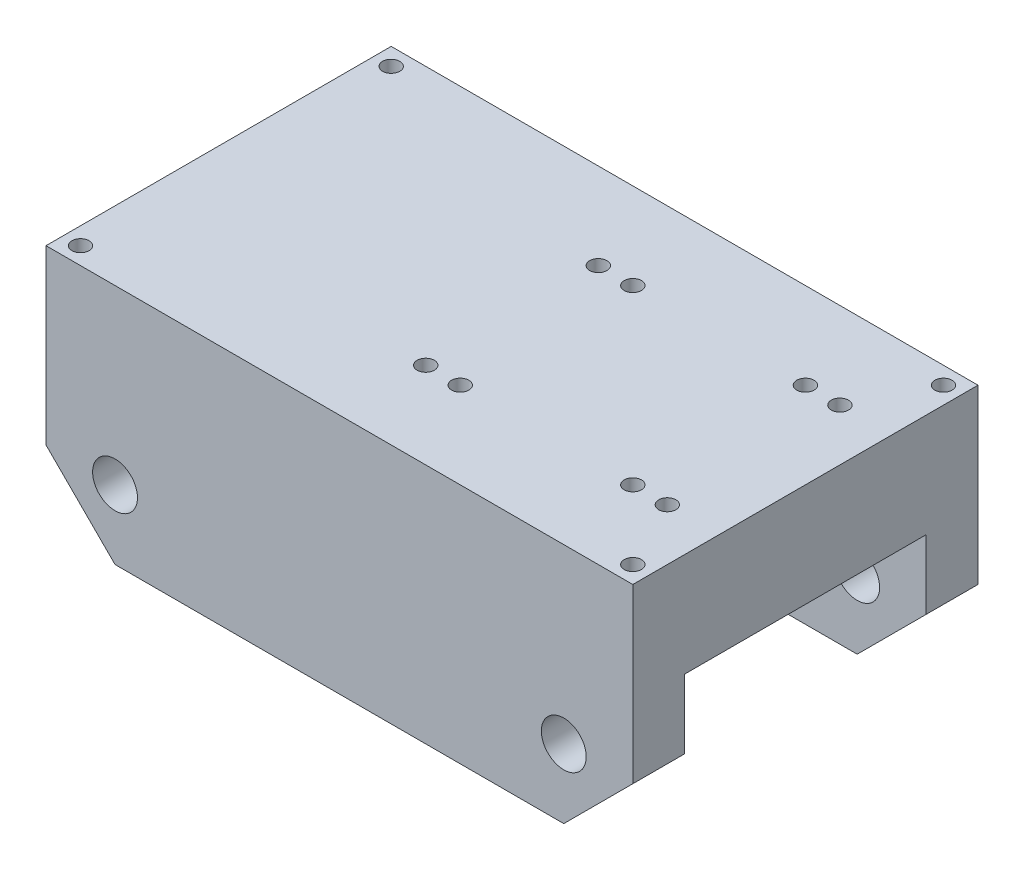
ISO-10303-21;
HEADER;
FILE_DESCRIPTION(('STEP AP214'),'2;1');
FILE_NAME('part.step','',(''),(''),'','','');
FILE_SCHEMA(('AUTOMOTIVE_DESIGN { 1 0 10303 214 1 1 1 1 }'));
ENDSEC;
DATA;
#1=APPLICATION_CONTEXT('core data for automotive mechanical design processes');
#2=APPLICATION_PROTOCOL_DEFINITION('international standard','automotive_design',2000,#1);
#3=PRODUCT_CONTEXT('',#1,'mechanical');
#4=PRODUCT('Part','Part','',(#3));
#5=PRODUCT_RELATED_PRODUCT_CATEGORY('part','',(#4));
#6=PRODUCT_DEFINITION_FORMATION('','',#4);
#7=PRODUCT_DEFINITION_CONTEXT('part definition',#1,'design');
#8=PRODUCT_DEFINITION('design','',#6,#7);
#9=PRODUCT_DEFINITION_SHAPE('','',#8);
#10=(LENGTH_UNIT() NAMED_UNIT(*) SI_UNIT(.MILLI.,.METRE.));
#11=(NAMED_UNIT(*) PLANE_ANGLE_UNIT() SI_UNIT($,.RADIAN.));
#12=(NAMED_UNIT(*) SI_UNIT($,.STERADIAN.) SOLID_ANGLE_UNIT());
#13=UNCERTAINTY_MEASURE_WITH_UNIT(LENGTH_MEASURE(1.E-05),#10,'distance_accuracy_value','');
#14=(GEOMETRIC_REPRESENTATION_CONTEXT(3) GLOBAL_UNCERTAINTY_ASSIGNED_CONTEXT((#13)) GLOBAL_UNIT_ASSIGNED_CONTEXT((#10,
#11,#12)) REPRESENTATION_CONTEXT('',''));
#15=CARTESIAN_POINT('',(0.,0.,0.));
#16=DIRECTION('',(0.,0.,1.));
#17=DIRECTION('',(1.,0.,0.));
#18=AXIS2_PLACEMENT_3D('',#15,#16,#17);
#19=CARTESIAN_POINT('',(20.,20.,100.));
#20=DIRECTION('',(-0.707106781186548,0.707106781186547,0.));
#21=DIRECTION('',(-0.707106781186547,-0.707106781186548,0.));
#22=AXIS2_PLACEMENT_3D('',#19,#20,#21);
#23=PLANE('',#22);
#24=DIRECTION('',(0.,0.,-1.));
#25=VECTOR('',#24,1.);
#26=CARTESIAN_POINT('',(0.,0.,100.));
#27=LINE('',#26,#25);
#28=CARTESIAN_POINT('',(0.,0.,100.));
#29=VERTEX_POINT('',#28);
#30=CARTESIAN_POINT('',(0.,0.,85.));
#31=VERTEX_POINT('',#30);
#32=EDGE_CURVE('E152',#29,#31,#27,.T.);
#33=ORIENTED_EDGE('',*,*,#32,.T.);
#34=DIRECTION('',(0.707106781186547,0.707106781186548,0.));
#35=VECTOR('',#34,1.);
#36=CARTESIAN_POINT('',(20.,20.,85.));
#37=LINE('',#36,#35);
#38=CARTESIAN_POINT('',(20.,20.,85.));
#39=VERTEX_POINT('',#38);
#40=EDGE_CURVE('E196',#31,#39,#37,.T.);
#41=ORIENTED_EDGE('',*,*,#40,.T.);
#42=DIRECTION('',(0.,0.,-1.));
#43=VECTOR('',#42,1.);
#44=CARTESIAN_POINT('',(20.,20.,100.));
#45=LINE('',#44,#43);
#46=CARTESIAN_POINT('',(20.,20.,100.));
#47=VERTEX_POINT('',#46);
#48=EDGE_CURVE('E11',#47,#39,#45,.T.);
#49=ORIENTED_EDGE('',*,*,#48,.F.);
#50=DIRECTION('',(0.707106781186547,0.707106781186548,0.));
#51=VECTOR('',#50,1.);
#52=CARTESIAN_POINT('',(20.,20.,100.));
#53=LINE('',#52,#51);
#54=EDGE_CURVE('E151',#29,#47,#53,.T.);
#55=ORIENTED_EDGE('',*,*,#54,.F.);
#56=EDGE_LOOP('',(#33,#41,#49,#55));
#57=FACE_BOUND('',#56,.T.);
#58=ADVANCED_FACE('F32',(#57),#23,.F.);
#59=CARTESIAN_POINT('',(-130.,0.,100.));
#60=DIRECTION('',(0.707106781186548,0.707106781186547,0.));
#61=DIRECTION('',(-0.707106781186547,0.707106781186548,0.));
#62=AXIS2_PLACEMENT_3D('',#59,#60,#61);
#63=PLANE('',#62);
#64=DIRECTION('',(0.,0.,-1.));
#65=VECTOR('',#64,1.);
#66=CARTESIAN_POINT('',(-150.,20.,100.));
#67=LINE('',#66,#65);
#68=CARTESIAN_POINT('',(-150.,20.,100.));
#69=VERTEX_POINT('',#68);
#70=CARTESIAN_POINT('',(-150.,20.,85.));
#71=VERTEX_POINT('',#70);
#72=EDGE_CURVE('E118',#69,#71,#67,.T.);
#73=ORIENTED_EDGE('',*,*,#72,.T.);
#74=DIRECTION('',(0.707106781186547,-0.707106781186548,0.));
#75=VECTOR('',#74,1.);
#76=CARTESIAN_POINT('',(-130.,0.,85.));
#77=LINE('',#76,#75);
#78=CARTESIAN_POINT('',(-130.,0.,85.));
#79=VERTEX_POINT('',#78);
#80=EDGE_CURVE('E194',#71,#79,#77,.T.);
#81=ORIENTED_EDGE('',*,*,#80,.T.);
#82=DIRECTION('',(0.,0.,-1.));
#83=VECTOR('',#82,1.);
#84=CARTESIAN_POINT('',(-130.,0.,100.));
#85=LINE('',#84,#83);
#86=CARTESIAN_POINT('',(-130.,0.,100.));
#87=VERTEX_POINT('',#86);
#88=EDGE_CURVE('E131',#87,#79,#85,.T.);
#89=ORIENTED_EDGE('',*,*,#88,.F.);
#90=DIRECTION('',(0.707106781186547,-0.707106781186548,0.));
#91=VECTOR('',#90,1.);
#92=CARTESIAN_POINT('',(-130.,0.,100.));
#93=LINE('',#92,#91);
#94=EDGE_CURVE('E108',#69,#87,#93,.T.);
#95=ORIENTED_EDGE('',*,*,#94,.F.);
#96=EDGE_LOOP('',(#73,#81,#89,#95));
#97=FACE_BOUND('',#96,.T.);
#98=ADVANCED_FACE('F129',(#97),#63,.F.);
#99=CARTESIAN_POINT('',(0.,0.,100.));
#100=DIRECTION('',(0.,1.,0.));
#101=DIRECTION('',(-1.,0.,0.));
#102=AXIS2_PLACEMENT_3D('',#99,#100,#101);
#103=PLANE('',#102);
#104=ORIENTED_EDGE('',*,*,#88,.T.);
#105=DIRECTION('',(1.,0.,0.));
#106=VECTOR('',#105,1.);
#107=CARTESIAN_POINT('',(0.,0.,85.));
#108=LINE('',#107,#106);
#109=EDGE_CURVE('E191',#79,#31,#108,.T.);
#110=ORIENTED_EDGE('',*,*,#109,.T.);
#111=ORIENTED_EDGE('',*,*,#32,.F.);
#112=DIRECTION('',(1.,0.,0.));
#113=VECTOR('',#112,1.);
#114=CARTESIAN_POINT('',(0.,0.,100.));
#115=LINE('',#114,#113);
#116=EDGE_CURVE('E58',#87,#29,#115,.T.);
#117=ORIENTED_EDGE('',*,*,#116,.F.);
#118=EDGE_LOOP('',(#104,#110,#111,#117));
#119=FACE_BOUND('',#118,.T.);
#120=ADVANCED_FACE('F254',(#119),#103,.F.);
#121=CARTESIAN_POINT('',(-130.,20.,100.));
#122=DIRECTION('',(0.,0.,-1.));
#123=DIRECTION('',(-1.,0.,0.));
#124=AXIS2_PLACEMENT_3D('',#121,#122,#123);
#125=CYLINDRICAL_SURFACE('',#124,6.5);
#126=CARTESIAN_POINT('',(-130.,20.,85.));
#127=DIRECTION('',(0.,0.,1.));
#128=DIRECTION('',(0.,-1.,0.));
#129=AXIS2_PLACEMENT_3D('',#126,#127,#128);
#130=CIRCLE('',#129,6.5);
#131=CARTESIAN_POINT('',(-130.,13.5,85.));
#132=VERTEX_POINT('',#131);
#133=EDGE_CURVE('E188',#132,#132,#130,.T.);
#134=ORIENTED_EDGE('',*,*,#133,.F.);
#135=EDGE_LOOP('',(#134));
#136=FACE_BOUND('',#135,.T.);
#137=CARTESIAN_POINT('',(-130.,20.,100.));
#138=DIRECTION('',(0.,0.,1.));
#139=DIRECTION('',(1.,0.,0.));
#140=AXIS2_PLACEMENT_3D('',#137,#138,#139);
#141=CIRCLE('',#140,6.5);
#142=CARTESIAN_POINT('',(-123.5,20.,100.));
#143=VERTEX_POINT('',#142);
#144=EDGE_CURVE('E139',#143,#143,#141,.T.);
#145=ORIENTED_EDGE('',*,*,#144,.T.);
#146=EDGE_LOOP('',(#145));
#147=FACE_BOUND('',#146,.T.);
#148=ADVANCED_FACE('F418',(#136,#147),#125,.F.);
#149=CARTESIAN_POINT('',(0.,20.,100.));
#150=DIRECTION('',(0.,0.,-1.));
#151=DIRECTION('',(-1.,0.,0.));
#152=AXIS2_PLACEMENT_3D('',#149,#150,#151);
#153=CYLINDRICAL_SURFACE('',#152,6.5);
#154=CARTESIAN_POINT('',(0.,20.,85.));
#155=DIRECTION('',(0.,0.,1.));
#156=DIRECTION('',(0.,-1.,0.));
#157=AXIS2_PLACEMENT_3D('',#154,#155,#156);
#158=CIRCLE('',#157,6.5);
#159=CARTESIAN_POINT('',(0.,13.5,85.));
#160=VERTEX_POINT('',#159);
#161=EDGE_CURVE('E36',#160,#160,#158,.T.);
#162=ORIENTED_EDGE('',*,*,#161,.F.);
#163=EDGE_LOOP('',(#162));
#164=FACE_BOUND('',#163,.T.);
#165=CARTESIAN_POINT('',(0.,20.,100.));
#166=DIRECTION('',(0.,0.,1.));
#167=DIRECTION('',(1.,0.,0.));
#168=AXIS2_PLACEMENT_3D('',#165,#166,#167);
#169=CIRCLE('',#168,6.5);
#170=CARTESIAN_POINT('',(6.49999999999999,20.,100.));
#171=VERTEX_POINT('',#170);
#172=EDGE_CURVE('E200',#171,#171,#169,.T.);
#173=ORIENTED_EDGE('',*,*,#172,.T.);
#174=EDGE_LOOP('',(#173));
#175=FACE_BOUND('',#174,.T.);
#176=ADVANCED_FACE('F423',(#164,#175),#153,.F.);
#177=CARTESIAN_POINT('',(0.,0.,100.));
#178=DIRECTION('',(0.,0.,-1.));
#179=DIRECTION('',(-1.,0.,0.));
#180=AXIS2_PLACEMENT_3D('',#177,#178,#179);
#181=PLANE('',#180);
#182=ORIENTED_EDGE('',*,*,#144,.F.);
#183=EDGE_LOOP('',(#182));
#184=FACE_BOUND('',#183,.T.);
#185=ORIENTED_EDGE('',*,*,#54,.T.);
#186=DIRECTION('',(0.,1.,0.));
#187=VECTOR('',#186,1.);
#188=CARTESIAN_POINT('',(20.,70.,100.));
#189=LINE('',#188,#187);
#190=CARTESIAN_POINT('',(20.,70.,100.));
#191=VERTEX_POINT('',#190);
#192=EDGE_CURVE('E94',#47,#191,#189,.T.);
#193=ORIENTED_EDGE('',*,*,#192,.T.);
#194=DIRECTION('',(-1.,0.,0.));
#195=VECTOR('',#194,1.);
#196=CARTESIAN_POINT('',(-150.,70.,100.));
#197=LINE('',#196,#195);
#198=CARTESIAN_POINT('',(-150.,70.,100.));
#199=VERTEX_POINT('',#198);
#200=EDGE_CURVE('E111',#191,#199,#197,.T.);
#201=ORIENTED_EDGE('',*,*,#200,.T.);
#202=DIRECTION('',(0.,-1.,0.));
#203=VECTOR('',#202,1.);
#204=CARTESIAN_POINT('',(-150.,20.,100.));
#205=LINE('',#204,#203);
#206=EDGE_CURVE('E103',#199,#69,#205,.T.);
#207=ORIENTED_EDGE('',*,*,#206,.T.);
#208=ORIENTED_EDGE('',*,*,#94,.T.);
#209=ORIENTED_EDGE('',*,*,#116,.T.);
#210=EDGE_LOOP('',(#185,#193,#201,#207,#208,#209));
#211=FACE_BOUND('',#210,.T.);
#212=ORIENTED_EDGE('',*,*,#172,.F.);
#213=EDGE_LOOP('',(#212));
#214=FACE_BOUND('',#213,.T.);
#215=ADVANCED_FACE('F105',(#184,#211,#214),#181,.F.);
#216=CARTESIAN_POINT('',(0.,0.,0.));
#217=DIRECTION('',(0.,0.,-1.));
#218=DIRECTION('',(-1.,0.,0.));
#219=AXIS2_PLACEMENT_3D('',#216,#217,#218);
#220=PLANE('',#219);
#221=CARTESIAN_POINT('',(-130.,20.,0.));
#222=DIRECTION('',(0.,0.,1.));
#223=DIRECTION('',(1.,0.,0.));
#224=AXIS2_PLACEMENT_3D('',#221,#222,#223);
#225=CIRCLE('',#224,6.5);
#226=CARTESIAN_POINT('',(-123.5,20.,0.));
#227=VERTEX_POINT('',#226);
#228=EDGE_CURVE('E203',#227,#227,#225,.T.);
#229=ORIENTED_EDGE('',*,*,#228,.T.);
#230=EDGE_LOOP('',(#229));
#231=FACE_BOUND('',#230,.T.);
#232=DIRECTION('',(0.707106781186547,0.707106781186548,0.));
#233=VECTOR('',#232,1.);
#234=CARTESIAN_POINT('',(20.,20.,0.));
#235=LINE('',#234,#233);
#236=CARTESIAN_POINT('',(0.,0.,0.));
#237=VERTEX_POINT('',#236);
#238=CARTESIAN_POINT('',(20.,20.,0.));
#239=VERTEX_POINT('',#238);
#240=EDGE_CURVE('E136',#237,#239,#235,.T.);
#241=ORIENTED_EDGE('',*,*,#240,.F.);
#242=DIRECTION('',(1.,0.,0.));
#243=VECTOR('',#242,1.);
#244=CARTESIAN_POINT('',(0.,0.,0.));
#245=LINE('',#244,#243);
#246=CARTESIAN_POINT('',(-130.,0.,0.));
#247=VERTEX_POINT('',#246);
#248=EDGE_CURVE('E149',#247,#237,#245,.T.);
#249=ORIENTED_EDGE('',*,*,#248,.F.);
#250=DIRECTION('',(0.707106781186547,-0.707106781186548,0.));
#251=VECTOR('',#250,1.);
#252=CARTESIAN_POINT('',(-130.,0.,0.));
#253=LINE('',#252,#251);
#254=CARTESIAN_POINT('',(-150.,20.,0.));
#255=VERTEX_POINT('',#254);
#256=EDGE_CURVE('E146',#255,#247,#253,.T.);
#257=ORIENTED_EDGE('',*,*,#256,.F.);
#258=DIRECTION('',(0.,-1.,0.));
#259=VECTOR('',#258,1.);
#260=CARTESIAN_POINT('',(-150.,20.,0.));
#261=LINE('',#260,#259);
#262=CARTESIAN_POINT('',(-150.,70.,0.));
#263=VERTEX_POINT('',#262);
#264=EDGE_CURVE('E143',#263,#255,#261,.T.);
#265=ORIENTED_EDGE('',*,*,#264,.F.);
#266=DIRECTION('',(-1.,0.,0.));
#267=VECTOR('',#266,1.);
#268=CARTESIAN_POINT('',(-150.,70.,0.));
#269=LINE('',#268,#267);
#270=CARTESIAN_POINT('',(20.,70.,0.));
#271=VERTEX_POINT('',#270);
#272=EDGE_CURVE('E141',#271,#263,#269,.T.);
#273=ORIENTED_EDGE('',*,*,#272,.F.);
#274=DIRECTION('',(0.,1.,0.));
#275=VECTOR('',#274,1.);
#276=CARTESIAN_POINT('',(20.,70.,0.));
#277=LINE('',#276,#275);
#278=EDGE_CURVE('E138',#239,#271,#277,.T.);
#279=ORIENTED_EDGE('',*,*,#278,.F.);
#280=EDGE_LOOP('',(#241,#249,#257,#265,#273,#279));
#281=FACE_BOUND('',#280,.T.);
#282=CARTESIAN_POINT('',(0.,20.,0.));
#283=DIRECTION('',(0.,0.,1.));
#284=DIRECTION('',(1.,0.,0.));
#285=AXIS2_PLACEMENT_3D('',#282,#283,#284);
#286=CIRCLE('',#285,6.5);
#287=CARTESIAN_POINT('',(6.49999999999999,20.,0.));
#288=VERTEX_POINT('',#287);
#289=EDGE_CURVE('E199',#288,#288,#286,.T.);
#290=ORIENTED_EDGE('',*,*,#289,.T.);
#291=EDGE_LOOP('',(#290));
#292=FACE_BOUND('',#291,.T.);
#293=ADVANCED_FACE('F223',(#231,#281,#292),#220,.T.);
#294=CARTESIAN_POINT('',(20.,20.,15.));
#295=VERTEX_POINT('',#294);
#296=EDGE_CURVE('E41',#295,#239,#45,.T.);
#297=ORIENTED_EDGE('',*,*,#296,.F.);
#298=DIRECTION('',(-0.707106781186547,-0.707106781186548,0.));
#299=VECTOR('',#298,1.);
#300=CARTESIAN_POINT('',(20.,20.,15.));
#301=LINE('',#300,#299);
#302=CARTESIAN_POINT('',(0.,0.,15.));
#303=VERTEX_POINT('',#302);
#304=EDGE_CURVE('E186',#295,#303,#301,.T.);
#305=ORIENTED_EDGE('',*,*,#304,.T.);
#306=EDGE_CURVE('E86',#303,#237,#27,.T.);
#307=ORIENTED_EDGE('',*,*,#306,.T.);
#308=ORIENTED_EDGE('',*,*,#240,.T.);
#309=EDGE_LOOP('',(#297,#305,#307,#308));
#310=FACE_BOUND('',#309,.T.);
#311=ADVANCED_FACE('F34',(#310),#23,.F.);
#312=CARTESIAN_POINT('',(20.,70.,100.));
#313=DIRECTION('',(-1.,0.,0.));
#314=DIRECTION('',(0.,-1.,0.));
#315=AXIS2_PLACEMENT_3D('',#312,#313,#314);
#316=PLANE('',#315);
#317=ORIENTED_EDGE('',*,*,#48,.T.);
#318=DIRECTION('',(0.,-1.,0.));
#319=VECTOR('',#318,1.);
#320=CARTESIAN_POINT('',(20.,40.,85.));
#321=LINE('',#320,#319);
#322=CARTESIAN_POINT('',(20.,40.,85.));
#323=VERTEX_POINT('',#322);
#324=EDGE_CURVE('E251',#323,#39,#321,.T.);
#325=ORIENTED_EDGE('',*,*,#324,.F.);
#326=DIRECTION('',(0.,0.,1.));
#327=VECTOR('',#326,1.);
#328=CARTESIAN_POINT('',(20.,40.,85.));
#329=LINE('',#328,#327);
#330=CARTESIAN_POINT('',(20.,40.,15.));
#331=VERTEX_POINT('',#330);
#332=EDGE_CURVE('E181',#331,#323,#329,.T.);
#333=ORIENTED_EDGE('',*,*,#332,.F.);
#334=DIRECTION('',(0.,1.,0.));
#335=VECTOR('',#334,1.);
#336=CARTESIAN_POINT('',(20.,40.,15.));
#337=LINE('',#336,#335);
#338=EDGE_CURVE('E258',#295,#331,#337,.T.);
#339=ORIENTED_EDGE('',*,*,#338,.F.);
#340=ORIENTED_EDGE('',*,*,#296,.T.);
#341=ORIENTED_EDGE('',*,*,#278,.T.);
#342=DIRECTION('',(0.,0.,-1.));
#343=VECTOR('',#342,1.);
#344=CARTESIAN_POINT('',(20.,70.,100.));
#345=LINE('',#344,#343);
#346=EDGE_CURVE('E158',#191,#271,#345,.T.);
#347=ORIENTED_EDGE('',*,*,#346,.F.);
#348=ORIENTED_EDGE('',*,*,#192,.F.);
#349=EDGE_LOOP('',(#317,#325,#333,#339,#340,#341,#347,#348));
#350=FACE_BOUND('',#349,.T.);
#351=ADVANCED_FACE('F213',(#350),#316,.F.);
#352=CARTESIAN_POINT('',(-150.,70.,100.));
#353=DIRECTION('',(0.,-1.,0.));
#354=DIRECTION('',(0.,0.,-1.));
#355=AXIS2_PLACEMENT_3D('',#352,#353,#354);
#356=PLANE('',#355);
#357=CARTESIAN_POINT('',(-55.,70.,75.));
#358=DIRECTION('',(0.,1.,0.));
#359=DIRECTION('',(0.,0.,1.));
#360=AXIS2_PLACEMENT_3D('',#357,#358,#359);
#361=CIRCLE('',#360,2.5);
#362=CARTESIAN_POINT('',(-55.,70.,77.5));
#363=VERTEX_POINT('',#362);
#364=EDGE_CURVE('E332',#363,#363,#361,.T.);
#365=ORIENTED_EDGE('',*,*,#364,.F.);
#366=EDGE_LOOP('',(#365));
#367=FACE_BOUND('',#366,.T.);
#368=CARTESIAN_POINT('',(-55.,70.,25.));
#369=DIRECTION('',(0.,1.,0.));
#370=DIRECTION('',(0.,0.,1.));
#371=AXIS2_PLACEMENT_3D('',#368,#369,#370);
#372=CIRCLE('',#371,2.5);
#373=CARTESIAN_POINT('',(-55.,70.,27.5));
#374=VERTEX_POINT('',#373);
#375=EDGE_CURVE('E326',#374,#374,#372,.T.);
#376=ORIENTED_EDGE('',*,*,#375,.F.);
#377=EDGE_LOOP('',(#376));
#378=FACE_BOUND('',#377,.T.);
#379=CARTESIAN_POINT('',(-4.99999999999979,70.,25.));
#380=DIRECTION('',(0.,1.,0.));
#381=DIRECTION('',(0.,0.,1.));
#382=AXIS2_PLACEMENT_3D('',#379,#380,#381);
#383=CIRCLE('',#382,2.5);
#384=CARTESIAN_POINT('',(-4.99999999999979,70.,27.5));
#385=VERTEX_POINT('',#384);
#386=EDGE_CURVE('E320',#385,#385,#383,.T.);
#387=ORIENTED_EDGE('',*,*,#386,.F.);
#388=EDGE_LOOP('',(#387));
#389=FACE_BOUND('',#388,.T.);
#390=CARTESIAN_POINT('',(4.99999999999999,70.,25.));
#391=DIRECTION('',(0.,1.,0.));
#392=DIRECTION('',(0.,0.,1.));
#393=AXIS2_PLACEMENT_3D('',#390,#391,#392);
#394=CIRCLE('',#393,2.5);
#395=CARTESIAN_POINT('',(4.99999999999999,70.,27.5));
#396=VERTEX_POINT('',#395);
#397=EDGE_CURVE('E314',#396,#396,#394,.T.);
#398=ORIENTED_EDGE('',*,*,#397,.F.);
#399=EDGE_LOOP('',(#398));
#400=FACE_BOUND('',#399,.T.);
#401=CARTESIAN_POINT('',(4.99999999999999,70.,75.));
#402=DIRECTION('',(0.,1.,0.));
#403=DIRECTION('',(0.,0.,1.));
#404=AXIS2_PLACEMENT_3D('',#401,#402,#403);
#405=CIRCLE('',#404,2.5);
#406=CARTESIAN_POINT('',(4.99999999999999,70.,77.5));
#407=VERTEX_POINT('',#406);
#408=EDGE_CURVE('E308',#407,#407,#405,.T.);
#409=ORIENTED_EDGE('',*,*,#408,.F.);
#410=EDGE_LOOP('',(#409));
#411=FACE_BOUND('',#410,.T.);
#412=CARTESIAN_POINT('',(-4.99999999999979,70.,75.));
#413=DIRECTION('',(0.,1.,0.));
#414=DIRECTION('',(0.,0.,1.));
#415=AXIS2_PLACEMENT_3D('',#412,#413,#414);
#416=CIRCLE('',#415,2.5);
#417=CARTESIAN_POINT('',(-4.99999999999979,70.,77.5));
#418=VERTEX_POINT('',#417);
#419=EDGE_CURVE('E302',#418,#418,#416,.T.);
#420=ORIENTED_EDGE('',*,*,#419,.F.);
#421=EDGE_LOOP('',(#420));
#422=FACE_BOUND('',#421,.T.);
#423=CARTESIAN_POINT('',(-64.9999999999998,70.,75.));
#424=DIRECTION('',(0.,1.,0.));
#425=DIRECTION('',(0.,0.,1.));
#426=AXIS2_PLACEMENT_3D('',#423,#424,#425);
#427=CIRCLE('',#426,2.5);
#428=CARTESIAN_POINT('',(-64.9999999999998,70.,77.5));
#429=VERTEX_POINT('',#428);
#430=EDGE_CURVE('E296',#429,#429,#427,.T.);
#431=ORIENTED_EDGE('',*,*,#430,.F.);
#432=EDGE_LOOP('',(#431));
#433=FACE_BOUND('',#432,.T.);
#434=CARTESIAN_POINT('',(-65.,70.,25.));
#435=DIRECTION('',(0.,1.,0.));
#436=DIRECTION('',(0.,0.,1.));
#437=AXIS2_PLACEMENT_3D('',#434,#435,#436);
#438=CIRCLE('',#437,2.50000000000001);
#439=CARTESIAN_POINT('',(-65.,70.,27.5));
#440=VERTEX_POINT('',#439);
#441=EDGE_CURVE('E290',#440,#440,#438,.T.);
#442=ORIENTED_EDGE('',*,*,#441,.F.);
#443=EDGE_LOOP('',(#442));
#444=FACE_BOUND('',#443,.T.);
#445=CARTESIAN_POINT('',(-145.,70.,95.));
#446=DIRECTION('',(0.,1.,0.));
#447=DIRECTION('',(0.,0.,1.));
#448=AXIS2_PLACEMENT_3D('',#445,#446,#447);
#449=CIRCLE('',#448,2.5);
#450=CARTESIAN_POINT('',(-145.,70.,97.5));
#451=VERTEX_POINT('',#450);
#452=EDGE_CURVE('E284',#451,#451,#449,.T.);
#453=ORIENTED_EDGE('',*,*,#452,.F.);
#454=EDGE_LOOP('',(#453));
#455=FACE_BOUND('',#454,.T.);
#456=CARTESIAN_POINT('',(15.,70.,95.));
#457=DIRECTION('',(0.,1.,0.));
#458=DIRECTION('',(0.,0.,1.));
#459=AXIS2_PLACEMENT_3D('',#456,#457,#458);
#460=CIRCLE('',#459,2.5);
#461=CARTESIAN_POINT('',(15.,70.,97.5));
#462=VERTEX_POINT('',#461);
#463=EDGE_CURVE('E278',#462,#462,#460,.T.);
#464=ORIENTED_EDGE('',*,*,#463,.F.);
#465=EDGE_LOOP('',(#464));
#466=FACE_BOUND('',#465,.T.);
#467=CARTESIAN_POINT('',(15.,70.,5.));
#468=DIRECTION('',(0.,1.,0.));
#469=DIRECTION('',(0.,0.,1.));
#470=AXIS2_PLACEMENT_3D('',#467,#468,#469);
#471=CIRCLE('',#470,2.5);
#472=CARTESIAN_POINT('',(15.,70.,7.5));
#473=VERTEX_POINT('',#472);
#474=EDGE_CURVE('E272',#473,#473,#471,.T.);
#475=ORIENTED_EDGE('',*,*,#474,.F.);
#476=EDGE_LOOP('',(#475));
#477=FACE_BOUND('',#476,.T.);
#478=CARTESIAN_POINT('',(-145.,70.,5.));
#479=DIRECTION('',(0.,1.,0.));
#480=DIRECTION('',(0.,0.,1.));
#481=AXIS2_PLACEMENT_3D('',#478,#479,#480);
#482=CIRCLE('',#481,2.5);
#483=CARTESIAN_POINT('',(-145.,70.,7.5));
#484=VERTEX_POINT('',#483);
#485=EDGE_CURVE('E263',#484,#484,#482,.T.);
#486=ORIENTED_EDGE('',*,*,#485,.F.);
#487=EDGE_LOOP('',(#486));
#488=FACE_BOUND('',#487,.T.);
#489=ORIENTED_EDGE('',*,*,#272,.T.);
#490=DIRECTION('',(0.,0.,-1.));
#491=VECTOR('',#490,1.);
#492=CARTESIAN_POINT('',(-150.,70.,100.));
#493=LINE('',#492,#491);
#494=EDGE_CURVE('E126',#199,#263,#493,.T.);
#495=ORIENTED_EDGE('',*,*,#494,.F.);
#496=ORIENTED_EDGE('',*,*,#200,.F.);
#497=ORIENTED_EDGE('',*,*,#346,.T.);
#498=EDGE_LOOP('',(#489,#495,#496,#497));
#499=FACE_BOUND('',#498,.T.);
#500=ADVANCED_FACE('F217',(#367,#378,#389,#400,#411,#422,#433,#444,#455,#466,#477,#488,#499),
#356,.F.);
#501=CARTESIAN_POINT('',(-150.,20.,100.));
#502=DIRECTION('',(1.,0.,0.));
#503=DIRECTION('',(0.,0.,-1.));
#504=AXIS2_PLACEMENT_3D('',#501,#502,#503);
#505=PLANE('',#504);
#506=DIRECTION('',(0.,0.,1.));
#507=VECTOR('',#506,1.);
#508=CARTESIAN_POINT('',(-150.,40.,85.));
#509=LINE('',#508,#507);
#510=CARTESIAN_POINT('',(-150.,40.,15.));
#511=VERTEX_POINT('',#510);
#512=CARTESIAN_POINT('',(-150.,40.,85.));
#513=VERTEX_POINT('',#512);
#514=EDGE_CURVE('E178',#511,#513,#509,.T.);
#515=ORIENTED_EDGE('',*,*,#514,.T.);
#516=DIRECTION('',(0.,-1.,0.));
#517=VECTOR('',#516,1.);
#518=CARTESIAN_POINT('',(-150.,40.,85.));
#519=LINE('',#518,#517);
#520=EDGE_CURVE('E123',#513,#71,#519,.T.);
#521=ORIENTED_EDGE('',*,*,#520,.T.);
#522=ORIENTED_EDGE('',*,*,#72,.F.);
#523=ORIENTED_EDGE('',*,*,#206,.F.);
#524=ORIENTED_EDGE('',*,*,#494,.T.);
#525=ORIENTED_EDGE('',*,*,#264,.T.);
#526=CARTESIAN_POINT('',(-150.,20.,15.));
#527=VERTEX_POINT('',#526);
#528=EDGE_CURVE('E127',#527,#255,#67,.T.);
#529=ORIENTED_EDGE('',*,*,#528,.F.);
#530=DIRECTION('',(0.,1.,0.));
#531=VECTOR('',#530,1.);
#532=CARTESIAN_POINT('',(-150.,40.,15.));
#533=LINE('',#532,#531);
#534=EDGE_CURVE('E232',#527,#511,#533,.T.);
#535=ORIENTED_EDGE('',*,*,#534,.T.);
#536=EDGE_LOOP('',(#515,#521,#522,#523,#524,#525,#529,#535));
#537=FACE_BOUND('',#536,.T.);
#538=ADVANCED_FACE('F120',(#537),#505,.F.);
#539=CARTESIAN_POINT('',(-130.,0.,15.));
#540=VERTEX_POINT('',#539);
#541=EDGE_CURVE('E155',#540,#247,#85,.T.);
#542=ORIENTED_EDGE('',*,*,#541,.F.);
#543=DIRECTION('',(-0.707106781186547,0.707106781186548,0.));
#544=VECTOR('',#543,1.);
#545=CARTESIAN_POINT('',(-130.,0.,15.));
#546=LINE('',#545,#544);
#547=EDGE_CURVE('E49',#540,#527,#546,.T.);
#548=ORIENTED_EDGE('',*,*,#547,.T.);
#549=ORIENTED_EDGE('',*,*,#528,.T.);
#550=ORIENTED_EDGE('',*,*,#256,.T.);
#551=EDGE_LOOP('',(#542,#548,#549,#550));
#552=FACE_BOUND('',#551,.T.);
#553=ADVANCED_FACE('F228',(#552),#63,.F.);
#554=ORIENTED_EDGE('',*,*,#306,.F.);
#555=DIRECTION('',(-1.,0.,0.));
#556=VECTOR('',#555,1.);
#557=CARTESIAN_POINT('',(0.,0.,15.));
#558=LINE('',#557,#556);
#559=EDGE_CURVE('E167',#303,#540,#558,.T.);
#560=ORIENTED_EDGE('',*,*,#559,.T.);
#561=ORIENTED_EDGE('',*,*,#541,.T.);
#562=ORIENTED_EDGE('',*,*,#248,.T.);
#563=EDGE_LOOP('',(#554,#560,#561,#562));
#564=FACE_BOUND('',#563,.T.);
#565=ADVANCED_FACE('F407',(#564),#103,.F.);
#566=CARTESIAN_POINT('',(-130.,20.,15.));
#567=DIRECTION('',(0.,0.,-1.));
#568=DIRECTION('',(0.,1.,0.));
#569=AXIS2_PLACEMENT_3D('',#566,#567,#568);
#570=CIRCLE('',#569,6.5);
#571=CARTESIAN_POINT('',(-130.,26.5,15.));
#572=VERTEX_POINT('',#571);
#573=EDGE_CURVE('E162',#572,#572,#570,.T.);
#574=ORIENTED_EDGE('',*,*,#573,.F.);
#575=EDGE_LOOP('',(#574));
#576=FACE_BOUND('',#575,.T.);
#577=ORIENTED_EDGE('',*,*,#228,.F.);
#578=EDGE_LOOP('',(#577));
#579=FACE_BOUND('',#578,.T.);
#580=ADVANCED_FACE('F409',(#576,#579),#125,.F.);
#581=CARTESIAN_POINT('',(0.,20.,15.));
#582=DIRECTION('',(0.,0.,-1.));
#583=DIRECTION('',(0.,1.,0.));
#584=AXIS2_PLACEMENT_3D('',#581,#582,#583);
#585=CIRCLE('',#584,6.5);
#586=CARTESIAN_POINT('',(0.,26.5,15.));
#587=VERTEX_POINT('',#586);
#588=EDGE_CURVE('E160',#587,#587,#585,.T.);
#589=ORIENTED_EDGE('',*,*,#588,.F.);
#590=EDGE_LOOP('',(#589));
#591=FACE_BOUND('',#590,.T.);
#592=ORIENTED_EDGE('',*,*,#289,.F.);
#593=EDGE_LOOP('',(#592));
#594=FACE_BOUND('',#593,.T.);
#595=ADVANCED_FACE('F415',(#591,#594),#153,.F.);
#596=CARTESIAN_POINT('',(-150.,40.,85.));
#597=DIRECTION('',(0.,0.,1.));
#598=DIRECTION('',(0.,-1.,0.));
#599=AXIS2_PLACEMENT_3D('',#596,#597,#598);
#600=PLANE('',#599);
#601=ORIENTED_EDGE('',*,*,#161,.T.);
#602=EDGE_LOOP('',(#601));
#603=FACE_BOUND('',#602,.T.);
#604=ORIENTED_EDGE('',*,*,#133,.T.);
#605=EDGE_LOOP('',(#604));
#606=FACE_BOUND('',#605,.T.);
#607=ORIENTED_EDGE('',*,*,#109,.F.);
#608=ORIENTED_EDGE('',*,*,#80,.F.);
#609=ORIENTED_EDGE('',*,*,#520,.F.);
#610=DIRECTION('',(1.,0.,0.));
#611=VECTOR('',#610,1.);
#612=CARTESIAN_POINT('',(-150.,40.,85.));
#613=LINE('',#612,#611);
#614=EDGE_CURVE('E163',#513,#323,#613,.T.);
#615=ORIENTED_EDGE('',*,*,#614,.T.);
#616=ORIENTED_EDGE('',*,*,#324,.T.);
#617=ORIENTED_EDGE('',*,*,#40,.F.);
#618=EDGE_LOOP('',(#607,#608,#609,#615,#616,#617));
#619=FACE_BOUND('',#618,.T.);
#620=ADVANCED_FACE('F249',(#603,#606,#619),#600,.F.);
#621=CARTESIAN_POINT('',(-150.,40.,15.));
#622=DIRECTION('',(0.,0.,-1.));
#623=DIRECTION('',(0.,1.,0.));
#624=AXIS2_PLACEMENT_3D('',#621,#622,#623);
#625=PLANE('',#624);
#626=ORIENTED_EDGE('',*,*,#588,.T.);
#627=EDGE_LOOP('',(#626));
#628=FACE_BOUND('',#627,.T.);
#629=ORIENTED_EDGE('',*,*,#573,.T.);
#630=EDGE_LOOP('',(#629));
#631=FACE_BOUND('',#630,.T.);
#632=ORIENTED_EDGE('',*,*,#338,.T.);
#633=DIRECTION('',(1.,0.,0.));
#634=VECTOR('',#633,1.);
#635=CARTESIAN_POINT('',(-150.,40.,15.));
#636=LINE('',#635,#634);
#637=EDGE_CURVE('E170',#511,#331,#636,.T.);
#638=ORIENTED_EDGE('',*,*,#637,.F.);
#639=ORIENTED_EDGE('',*,*,#534,.F.);
#640=ORIENTED_EDGE('',*,*,#547,.F.);
#641=ORIENTED_EDGE('',*,*,#559,.F.);
#642=ORIENTED_EDGE('',*,*,#304,.F.);
#643=EDGE_LOOP('',(#632,#638,#639,#640,#641,#642));
#644=FACE_BOUND('',#643,.T.);
#645=ADVANCED_FACE('F385',(#628,#631,#644),#625,.F.);
#646=CARTESIAN_POINT('',(-150.,40.,85.));
#647=DIRECTION('',(0.,1.,0.));
#648=DIRECTION('',(-1.,0.,0.));
#649=AXIS2_PLACEMENT_3D('',#646,#647,#648);
#650=PLANE('',#649);
#651=ORIENTED_EDGE('',*,*,#332,.T.);
#652=ORIENTED_EDGE('',*,*,#614,.F.);
#653=ORIENTED_EDGE('',*,*,#514,.F.);
#654=ORIENTED_EDGE('',*,*,#637,.T.);
#655=EDGE_LOOP('',(#651,#652,#653,#654));
#656=FACE_BOUND('',#655,.T.);
#657=ADVANCED_FACE('F375',(#656),#650,.F.);
#658=CARTESIAN_POINT('',(-145.,62.,5.));
#659=DIRECTION('',(0.,1.,0.));
#660=DIRECTION('',(0.,0.,1.));
#661=AXIS2_PLACEMENT_3D('',#658,#659,#660);
#662=CYLINDRICAL_SURFACE('',#661,2.5);
#663=CARTESIAN_POINT('',(-145.,62.,5.));
#664=DIRECTION('',(0.,1.,0.));
#665=DIRECTION('',(0.,0.,1.));
#666=AXIS2_PLACEMENT_3D('',#663,#664,#665);
#667=CIRCLE('',#666,2.5);
#668=CARTESIAN_POINT('',(-145.,62.,7.5));
#669=VERTEX_POINT('',#668);
#670=EDGE_CURVE('E259',#669,#669,#667,.T.);
#671=ORIENTED_EDGE('',*,*,#670,.F.);
#672=EDGE_LOOP('',(#671));
#673=FACE_BOUND('',#672,.T.);
#674=ORIENTED_EDGE('',*,*,#485,.T.);
#675=EDGE_LOOP('',(#674));
#676=FACE_BOUND('',#675,.T.);
#677=ADVANCED_FACE('F372',(#673,#676),#662,.F.);
#678=CARTESIAN_POINT('',(-145.,62.,5.));
#679=DIRECTION('',(0.,1.,0.));
#680=DIRECTION('',(0.,0.,1.));
#681=AXIS2_PLACEMENT_3D('',#678,#679,#680);
#682=PLANE('',#681);
#683=ORIENTED_EDGE('',*,*,#670,.T.);
#684=EDGE_LOOP('',(#683));
#685=FACE_BOUND('',#684,.T.);
#686=ADVANCED_FACE('F374',(#685),#682,.T.);
#687=CARTESIAN_POINT('',(15.,62.,5.));
#688=DIRECTION('',(0.,1.,0.));
#689=DIRECTION('',(0.,0.,1.));
#690=AXIS2_PLACEMENT_3D('',#687,#688,#689);
#691=CYLINDRICAL_SURFACE('',#690,2.5);
#692=CARTESIAN_POINT('',(15.,62.,5.));
#693=DIRECTION('',(0.,1.,0.));
#694=DIRECTION('',(0.,0.,1.));
#695=AXIS2_PLACEMENT_3D('',#692,#693,#694);
#696=CIRCLE('',#695,2.5);
#697=CARTESIAN_POINT('',(15.,62.,7.5));
#698=VERTEX_POINT('',#697);
#699=EDGE_CURVE('E270',#698,#698,#696,.T.);
#700=ORIENTED_EDGE('',*,*,#699,.F.);
#701=EDGE_LOOP('',(#700));
#702=FACE_BOUND('',#701,.T.);
#703=ORIENTED_EDGE('',*,*,#474,.T.);
#704=EDGE_LOOP('',(#703));
#705=FACE_BOUND('',#704,.T.);
#706=ADVANCED_FACE('F382',(#702,#705),#691,.F.);
#707=CARTESIAN_POINT('',(15.,62.,5.));
#708=DIRECTION('',(0.,1.,0.));
#709=DIRECTION('',(0.,0.,1.));
#710=AXIS2_PLACEMENT_3D('',#707,#708,#709);
#711=PLANE('',#710);
#712=ORIENTED_EDGE('',*,*,#699,.T.);
#713=EDGE_LOOP('',(#712));
#714=FACE_BOUND('',#713,.T.);
#715=ADVANCED_FACE('F551',(#714),#711,.T.);
#716=CARTESIAN_POINT('',(15.,62.,95.));
#717=DIRECTION('',(0.,1.,0.));
#718=DIRECTION('',(0.,0.,1.));
#719=AXIS2_PLACEMENT_3D('',#716,#717,#718);
#720=CYLINDRICAL_SURFACE('',#719,2.5);
#721=CARTESIAN_POINT('',(15.,62.,95.));
#722=DIRECTION('',(0.,1.,0.));
#723=DIRECTION('',(0.,0.,1.));
#724=AXIS2_PLACEMENT_3D('',#721,#722,#723);
#725=CIRCLE('',#724,2.5);
#726=CARTESIAN_POINT('',(15.,62.,97.5));
#727=VERTEX_POINT('',#726);
#728=EDGE_CURVE('E275',#727,#727,#725,.T.);
#729=ORIENTED_EDGE('',*,*,#728,.F.);
#730=EDGE_LOOP('',(#729));
#731=FACE_BOUND('',#730,.T.);
#732=ORIENTED_EDGE('',*,*,#463,.T.);
#733=EDGE_LOOP('',(#732));
#734=FACE_BOUND('',#733,.T.);
#735=ADVANCED_FACE('F561',(#731,#734),#720,.F.);
#736=CARTESIAN_POINT('',(15.,62.,95.));
#737=DIRECTION('',(0.,1.,0.));
#738=DIRECTION('',(0.,0.,1.));
#739=AXIS2_PLACEMENT_3D('',#736,#737,#738);
#740=PLANE('',#739);
#741=ORIENTED_EDGE('',*,*,#728,.T.);
#742=EDGE_LOOP('',(#741));
#743=FACE_BOUND('',#742,.T.);
#744=ADVANCED_FACE('F571',(#743),#740,.T.);
#745=CARTESIAN_POINT('',(-145.,62.,95.));
#746=DIRECTION('',(0.,1.,0.));
#747=DIRECTION('',(0.,0.,1.));
#748=AXIS2_PLACEMENT_3D('',#745,#746,#747);
#749=CYLINDRICAL_SURFACE('',#748,2.5);
#750=CARTESIAN_POINT('',(-145.,62.,95.));
#751=DIRECTION('',(0.,1.,0.));
#752=DIRECTION('',(0.,0.,1.));
#753=AXIS2_PLACEMENT_3D('',#750,#751,#752);
#754=CIRCLE('',#753,2.5);
#755=CARTESIAN_POINT('',(-145.,62.,97.5));
#756=VERTEX_POINT('',#755);
#757=EDGE_CURVE('E281',#756,#756,#754,.T.);
#758=ORIENTED_EDGE('',*,*,#757,.F.);
#759=EDGE_LOOP('',(#758));
#760=FACE_BOUND('',#759,.T.);
#761=ORIENTED_EDGE('',*,*,#452,.T.);
#762=EDGE_LOOP('',(#761));
#763=FACE_BOUND('',#762,.T.);
#764=ADVANCED_FACE('F581',(#760,#763),#749,.F.);
#765=CARTESIAN_POINT('',(-145.,62.,95.));
#766=DIRECTION('',(0.,1.,0.));
#767=DIRECTION('',(0.,0.,1.));
#768=AXIS2_PLACEMENT_3D('',#765,#766,#767);
#769=PLANE('',#768);
#770=ORIENTED_EDGE('',*,*,#757,.T.);
#771=EDGE_LOOP('',(#770));
#772=FACE_BOUND('',#771,.T.);
#773=ADVANCED_FACE('F591',(#772),#769,.T.);
#774=CARTESIAN_POINT('',(-65.,57.,25.));
#775=DIRECTION('',(0.,1.,0.));
#776=DIRECTION('',(0.,0.,1.));
#777=AXIS2_PLACEMENT_3D('',#774,#775,#776);
#778=CYLINDRICAL_SURFACE('',#777,2.50000000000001);
#779=CARTESIAN_POINT('',(-65.,57.,25.));
#780=DIRECTION('',(0.,1.,0.));
#781=DIRECTION('',(0.,0.,1.));
#782=AXIS2_PLACEMENT_3D('',#779,#780,#781);
#783=CIRCLE('',#782,2.50000000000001);
#784=CARTESIAN_POINT('',(-65.,57.,27.5));
#785=VERTEX_POINT('',#784);
#786=EDGE_CURVE('E287',#785,#785,#783,.T.);
#787=CARTESIAN_POINT('',(-65.,57.,27.5));
#788=CARTESIAN_POINT('',(-65.,57.1354166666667,27.5));
#789=CARTESIAN_POINT('',(-65.,57.2708333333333,27.5));
#790=CARTESIAN_POINT('',(-65.,57.5416666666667,27.5));
#791=CARTESIAN_POINT('',(-65.,57.6770833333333,27.5));
#792=CARTESIAN_POINT('',(-65.,57.9479166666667,27.5));
#793=CARTESIAN_POINT('',(-65.,58.0833333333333,27.5));
#794=CARTESIAN_POINT('',(-65.,58.3541666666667,27.5));
#795=CARTESIAN_POINT('',(-65.,58.4895833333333,27.5));
#796=CARTESIAN_POINT('',(-65.,58.7604166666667,27.5));
#797=CARTESIAN_POINT('',(-65.,58.8958333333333,27.5));
#798=CARTESIAN_POINT('',(-65.,59.1666666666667,27.5));
#799=CARTESIAN_POINT('',(-65.,59.3020833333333,27.5));
#800=CARTESIAN_POINT('',(-65.,59.5729166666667,27.5));
#801=CARTESIAN_POINT('',(-65.,59.7083333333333,27.5));
#802=CARTESIAN_POINT('',(-65.,59.9791666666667,27.5));
#803=CARTESIAN_POINT('',(-65.,60.1145833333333,27.5));
#804=CARTESIAN_POINT('',(-65.,60.3854166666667,27.5));
#805=CARTESIAN_POINT('',(-65.,60.5208333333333,27.5));
#806=CARTESIAN_POINT('',(-65.,60.7916666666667,27.5));
#807=CARTESIAN_POINT('',(-65.,60.9270833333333,27.5));
#808=CARTESIAN_POINT('',(-65.,61.1979166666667,27.5));
#809=CARTESIAN_POINT('',(-65.,61.3333333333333,27.5));
#810=CARTESIAN_POINT('',(-65.,61.6041666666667,27.5));
#811=CARTESIAN_POINT('',(-65.,61.7395833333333,27.5));
#812=CARTESIAN_POINT('',(-65.,62.0104166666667,27.5));
#813=CARTESIAN_POINT('',(-65.,62.1458333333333,27.5));
#814=CARTESIAN_POINT('',(-65.,62.4166666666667,27.5));
#815=CARTESIAN_POINT('',(-65.,62.5520833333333,27.5));
#816=CARTESIAN_POINT('',(-65.,62.8229166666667,27.5));
#817=CARTESIAN_POINT('',(-65.,62.9583333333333,27.5));
#818=CARTESIAN_POINT('',(-65.,63.2291666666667,27.5));
#819=CARTESIAN_POINT('',(-65.,63.3645833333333,27.5));
#820=CARTESIAN_POINT('',(-65.,63.6354166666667,27.5));
#821=CARTESIAN_POINT('',(-65.,63.7708333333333,27.5));
#822=CARTESIAN_POINT('',(-65.,64.0416666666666,27.5));
#823=CARTESIAN_POINT('',(-65.,64.1770833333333,27.5));
#824=CARTESIAN_POINT('',(-65.,64.4479166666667,27.5));
#825=CARTESIAN_POINT('',(-65.,64.5833333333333,27.5));
#826=CARTESIAN_POINT('',(-65.,64.8541666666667,27.5));
#827=CARTESIAN_POINT('',(-65.,64.9895833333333,27.5));
#828=CARTESIAN_POINT('',(-65.,65.2604166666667,27.5));
#829=CARTESIAN_POINT('',(-65.,65.3958333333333,27.5));
#830=CARTESIAN_POINT('',(-65.,65.6666666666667,27.5));
#831=CARTESIAN_POINT('',(-65.,65.8020833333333,27.5));
#832=CARTESIAN_POINT('',(-65.,66.0729166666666,27.5));
#833=CARTESIAN_POINT('',(-65.,66.2083333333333,27.5));
#834=CARTESIAN_POINT('',(-65.,66.4791666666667,27.5));
#835=CARTESIAN_POINT('',(-65.,66.6145833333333,27.5));
#836=CARTESIAN_POINT('',(-65.,66.8854166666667,27.5));
#837=CARTESIAN_POINT('',(-65.,67.0208333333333,27.5));
#838=CARTESIAN_POINT('',(-65.,67.2916666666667,27.5));
#839=CARTESIAN_POINT('',(-65.,67.4270833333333,27.5));
#840=CARTESIAN_POINT('',(-65.,67.6979166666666,27.5));
#841=CARTESIAN_POINT('',(-65.,67.8333333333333,27.5));
#842=CARTESIAN_POINT('',(-65.,68.1041666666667,27.5));
#843=CARTESIAN_POINT('',(-65.,68.2395833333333,27.5));
#844=CARTESIAN_POINT('',(-65.,68.5104166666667,27.5));
#845=CARTESIAN_POINT('',(-65.,68.6458333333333,27.5));
#846=CARTESIAN_POINT('',(-65.,68.9166666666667,27.5));
#847=CARTESIAN_POINT('',(-65.,69.0520833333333,27.5));
#848=CARTESIAN_POINT('',(-65.,69.3229166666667,27.5));
#849=CARTESIAN_POINT('',(-65.,69.4583333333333,27.5));
#850=CARTESIAN_POINT('',(-65.,69.7291666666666,27.5));
#851=CARTESIAN_POINT('',(-65.,69.8645833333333,27.5));
#852=CARTESIAN_POINT('',(-65.,70.,27.5));
#853=B_SPLINE_CURVE_WITH_KNOTS('',3,(#787,#788,#789,#790,#791,#792,#793,#794,#795,#796,#797,
#798,#799,#800,#801,#802,#803,#804,#805,#806,#807,#808,#809,#810,#811,#812,#813,#814,#815,#816,
#817,#818,#819,#820,#821,#822,#823,#824,#825,#826,#827,#828,#829,#830,#831,#832,#833,#834,#835,
#836,#837,#838,#839,#840,#841,#842,#843,#844,#845,#846,#847,#848,#849,#850,#851,#852),
.UNSPECIFIED.,.F.,.F.,(4,2,2,2,2,2,2,2,2,2,2,2,2,2,2,2,2,2,2,2,2,2,2,2,2,2,2,2,2,2,2,2,4),(0.,
0.406249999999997,0.812499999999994,1.21875,1.62499999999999,2.03125,2.4375,2.84374999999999,
3.25,3.65624999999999,4.0625,4.46874999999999,4.875,5.28124999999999,5.6875,6.09374999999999,
6.49999999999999,6.90624999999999,7.3125,7.71875,8.12499999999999,8.53124999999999,
8.93749999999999,9.34375,9.74999999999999,10.15625,10.5625,10.96875,11.375,11.78125,12.1875,
12.59375,13.),.UNSPECIFIED.);
#854=EDGE_CURVE('BSEAM601',#785,#440,#853,.T.);
#855=ORIENTED_EDGE('',*,*,#786,.F.);
#856=ORIENTED_EDGE('',*,*,#441,.T.);
#857=ORIENTED_EDGE('',*,*,#854,.T.);
#858=ORIENTED_EDGE('',*,*,#854,.F.);
#859=EDGE_LOOP('',(#855,#857,#856,#858));
#860=FACE_BOUND('',#859,.T.);
#861=ADVANCED_FACE('F601',(#860),#778,.F.);
#862=CARTESIAN_POINT('',(-65.,57.,25.));
#863=DIRECTION('',(0.,1.,0.));
#864=DIRECTION('',(0.,0.,1.));
#865=AXIS2_PLACEMENT_3D('',#862,#863,#864);
#866=PLANE('',#865);
#867=ORIENTED_EDGE('',*,*,#786,.T.);
#868=EDGE_LOOP('',(#867));
#869=FACE_BOUND('',#868,.T.);
#870=ADVANCED_FACE('F616',(#869),#866,.T.);
#871=CARTESIAN_POINT('',(-64.9999999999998,57.,75.));
#872=DIRECTION('',(0.,1.,0.));
#873=DIRECTION('',(0.,0.,1.));
#874=AXIS2_PLACEMENT_3D('',#871,#872,#873);
#875=CYLINDRICAL_SURFACE('',#874,2.5);
#876=CARTESIAN_POINT('',(-64.9999999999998,57.,75.));
#877=DIRECTION('',(0.,1.,0.));
#878=DIRECTION('',(0.,0.,1.));
#879=AXIS2_PLACEMENT_3D('',#876,#877,#878);
#880=CIRCLE('',#879,2.5);
#881=CARTESIAN_POINT('',(-64.9999999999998,57.,77.5));
#882=VERTEX_POINT('',#881);
#883=EDGE_CURVE('E293',#882,#882,#880,.T.);
#884=CARTESIAN_POINT('',(-64.9999999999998,57.,77.5));
#885=CARTESIAN_POINT('',(-64.9999999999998,57.1354166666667,77.5));
#886=CARTESIAN_POINT('',(-64.9999999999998,57.2708333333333,77.5));
#887=CARTESIAN_POINT('',(-64.9999999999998,57.5416666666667,77.5));
#888=CARTESIAN_POINT('',(-64.9999999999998,57.6770833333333,77.5));
#889=CARTESIAN_POINT('',(-64.9999999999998,57.9479166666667,77.5));
#890=CARTESIAN_POINT('',(-64.9999999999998,58.0833333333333,77.5));
#891=CARTESIAN_POINT('',(-64.9999999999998,58.3541666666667,77.5));
#892=CARTESIAN_POINT('',(-64.9999999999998,58.4895833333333,77.5));
#893=CARTESIAN_POINT('',(-64.9999999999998,58.7604166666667,77.5));
#894=CARTESIAN_POINT('',(-64.9999999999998,58.8958333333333,77.5));
#895=CARTESIAN_POINT('',(-64.9999999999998,59.1666666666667,77.5));
#896=CARTESIAN_POINT('',(-64.9999999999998,59.3020833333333,77.5));
#897=CARTESIAN_POINT('',(-64.9999999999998,59.5729166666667,77.5));
#898=CARTESIAN_POINT('',(-64.9999999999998,59.7083333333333,77.5));
#899=CARTESIAN_POINT('',(-64.9999999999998,59.9791666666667,77.5));
#900=CARTESIAN_POINT('',(-64.9999999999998,60.1145833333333,77.5));
#901=CARTESIAN_POINT('',(-64.9999999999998,60.3854166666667,77.5));
#902=CARTESIAN_POINT('',(-64.9999999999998,60.5208333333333,77.5));
#903=CARTESIAN_POINT('',(-64.9999999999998,60.7916666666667,77.5));
#904=CARTESIAN_POINT('',(-64.9999999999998,60.9270833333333,77.5));
#905=CARTESIAN_POINT('',(-64.9999999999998,61.1979166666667,77.5));
#906=CARTESIAN_POINT('',(-64.9999999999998,61.3333333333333,77.5));
#907=CARTESIAN_POINT('',(-64.9999999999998,61.6041666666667,77.5));
#908=CARTESIAN_POINT('',(-64.9999999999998,61.7395833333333,77.5));
#909=CARTESIAN_POINT('',(-64.9999999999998,62.0104166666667,77.5));
#910=CARTESIAN_POINT('',(-64.9999999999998,62.1458333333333,77.5));
#911=CARTESIAN_POINT('',(-64.9999999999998,62.4166666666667,77.5));
#912=CARTESIAN_POINT('',(-64.9999999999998,62.5520833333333,77.5));
#913=CARTESIAN_POINT('',(-64.9999999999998,62.8229166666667,77.5));
#914=CARTESIAN_POINT('',(-64.9999999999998,62.9583333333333,77.5));
#915=CARTESIAN_POINT('',(-64.9999999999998,63.2291666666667,77.5));
#916=CARTESIAN_POINT('',(-64.9999999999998,63.3645833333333,77.5));
#917=CARTESIAN_POINT('',(-64.9999999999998,63.6354166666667,77.5));
#918=CARTESIAN_POINT('',(-64.9999999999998,63.7708333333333,77.5));
#919=CARTESIAN_POINT('',(-64.9999999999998,64.0416666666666,77.5));
#920=CARTESIAN_POINT('',(-64.9999999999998,64.1770833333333,77.5));
#921=CARTESIAN_POINT('',(-64.9999999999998,64.4479166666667,77.5));
#922=CARTESIAN_POINT('',(-64.9999999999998,64.5833333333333,77.5));
#923=CARTESIAN_POINT('',(-64.9999999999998,64.8541666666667,77.5));
#924=CARTESIAN_POINT('',(-64.9999999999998,64.9895833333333,77.5));
#925=CARTESIAN_POINT('',(-64.9999999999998,65.2604166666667,77.5));
#926=CARTESIAN_POINT('',(-64.9999999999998,65.3958333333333,77.5));
#927=CARTESIAN_POINT('',(-64.9999999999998,65.6666666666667,77.5));
#928=CARTESIAN_POINT('',(-64.9999999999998,65.8020833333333,77.5));
#929=CARTESIAN_POINT('',(-64.9999999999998,66.0729166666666,77.5));
#930=CARTESIAN_POINT('',(-64.9999999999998,66.2083333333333,77.5));
#931=CARTESIAN_POINT('',(-64.9999999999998,66.4791666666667,77.5));
#932=CARTESIAN_POINT('',(-64.9999999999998,66.6145833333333,77.5));
#933=CARTESIAN_POINT('',(-64.9999999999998,66.8854166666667,77.5));
#934=CARTESIAN_POINT('',(-64.9999999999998,67.0208333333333,77.5));
#935=CARTESIAN_POINT('',(-64.9999999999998,67.2916666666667,77.5));
#936=CARTESIAN_POINT('',(-64.9999999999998,67.4270833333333,77.5));
#937=CARTESIAN_POINT('',(-64.9999999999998,67.6979166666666,77.5));
#938=CARTESIAN_POINT('',(-64.9999999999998,67.8333333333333,77.5));
#939=CARTESIAN_POINT('',(-64.9999999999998,68.1041666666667,77.5));
#940=CARTESIAN_POINT('',(-64.9999999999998,68.2395833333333,77.5));
#941=CARTESIAN_POINT('',(-64.9999999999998,68.5104166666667,77.5));
#942=CARTESIAN_POINT('',(-64.9999999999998,68.6458333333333,77.5));
#943=CARTESIAN_POINT('',(-64.9999999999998,68.9166666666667,77.5));
#944=CARTESIAN_POINT('',(-64.9999999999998,69.0520833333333,77.5));
#945=CARTESIAN_POINT('',(-64.9999999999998,69.3229166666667,77.5));
#946=CARTESIAN_POINT('',(-64.9999999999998,69.4583333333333,77.5));
#947=CARTESIAN_POINT('',(-64.9999999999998,69.7291666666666,77.5));
#948=CARTESIAN_POINT('',(-64.9999999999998,69.8645833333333,77.5));
#949=CARTESIAN_POINT('',(-64.9999999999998,70.,77.5));
#950=B_SPLINE_CURVE_WITH_KNOTS('',3,(#884,#885,#886,#887,#888,#889,#890,#891,#892,#893,#894,
#895,#896,#897,#898,#899,#900,#901,#902,#903,#904,#905,#906,#907,#908,#909,#910,#911,#912,#913,
#914,#915,#916,#917,#918,#919,#920,#921,#922,#923,#924,#925,#926,#927,#928,#929,#930,#931,#932,
#933,#934,#935,#936,#937,#938,#939,#940,#941,#942,#943,#944,#945,#946,#947,#948,#949),
.UNSPECIFIED.,.F.,.F.,(4,2,2,2,2,2,2,2,2,2,2,2,2,2,2,2,2,2,2,2,2,2,2,2,2,2,2,2,2,2,2,2,4),(0.,
0.406249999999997,0.812499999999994,1.21875,1.62499999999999,2.03125,2.4375,2.84374999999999,
3.25,3.65624999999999,4.0625,4.46874999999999,4.875,5.28124999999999,5.6875,6.09374999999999,
6.49999999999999,6.90624999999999,7.3125,7.71875,8.12499999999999,8.53124999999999,
8.93749999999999,9.34375,9.74999999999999,10.15625,10.5625,10.96875,11.375,11.78125,12.1875,
12.59375,13.),.UNSPECIFIED.);
#951=EDGE_CURVE('BSEAM626',#882,#429,#950,.T.);
#952=ORIENTED_EDGE('',*,*,#883,.F.);
#953=ORIENTED_EDGE('',*,*,#430,.T.);
#954=ORIENTED_EDGE('',*,*,#951,.T.);
#955=ORIENTED_EDGE('',*,*,#951,.F.);
#956=EDGE_LOOP('',(#952,#954,#953,#955));
#957=FACE_BOUND('',#956,.T.);
#958=ADVANCED_FACE('F626',(#957),#875,.F.);
#959=CARTESIAN_POINT('',(-64.9999999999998,57.,75.));
#960=DIRECTION('',(0.,1.,0.));
#961=DIRECTION('',(0.,0.,1.));
#962=AXIS2_PLACEMENT_3D('',#959,#960,#961);
#963=PLANE('',#962);
#964=ORIENTED_EDGE('',*,*,#883,.T.);
#965=EDGE_LOOP('',(#964));
#966=FACE_BOUND('',#965,.T.);
#967=ADVANCED_FACE('F636',(#966),#963,.T.);
#968=CARTESIAN_POINT('',(-4.99999999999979,57.,75.));
#969=DIRECTION('',(0.,1.,0.));
#970=DIRECTION('',(0.,0.,1.));
#971=AXIS2_PLACEMENT_3D('',#968,#969,#970);
#972=CYLINDRICAL_SURFACE('',#971,2.5);
#973=CARTESIAN_POINT('',(-4.99999999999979,57.,75.));
#974=DIRECTION('',(0.,1.,0.));
#975=DIRECTION('',(0.,0.,1.));
#976=AXIS2_PLACEMENT_3D('',#973,#974,#975);
#977=CIRCLE('',#976,2.5);
#978=CARTESIAN_POINT('',(-4.99999999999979,57.,77.5));
#979=VERTEX_POINT('',#978);
#980=EDGE_CURVE('E299',#979,#979,#977,.T.);
#981=CARTESIAN_POINT('',(-4.99999999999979,57.,77.5));
#982=CARTESIAN_POINT('',(-4.99999999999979,57.1354166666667,77.5));
#983=CARTESIAN_POINT('',(-4.99999999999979,57.2708333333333,77.5));
#984=CARTESIAN_POINT('',(-4.99999999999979,57.5416666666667,77.5));
#985=CARTESIAN_POINT('',(-4.99999999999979,57.6770833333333,77.5));
#986=CARTESIAN_POINT('',(-4.99999999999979,57.9479166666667,77.5));
#987=CARTESIAN_POINT('',(-4.99999999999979,58.0833333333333,77.5));
#988=CARTESIAN_POINT('',(-4.99999999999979,58.3541666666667,77.5));
#989=CARTESIAN_POINT('',(-4.99999999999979,58.4895833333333,77.5));
#990=CARTESIAN_POINT('',(-4.99999999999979,58.7604166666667,77.5));
#991=CARTESIAN_POINT('',(-4.99999999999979,58.8958333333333,77.5));
#992=CARTESIAN_POINT('',(-4.99999999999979,59.1666666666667,77.5));
#993=CARTESIAN_POINT('',(-4.99999999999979,59.3020833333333,77.5));
#994=CARTESIAN_POINT('',(-4.99999999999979,59.5729166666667,77.5));
#995=CARTESIAN_POINT('',(-4.99999999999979,59.7083333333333,77.5));
#996=CARTESIAN_POINT('',(-4.99999999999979,59.9791666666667,77.5));
#997=CARTESIAN_POINT('',(-4.99999999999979,60.1145833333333,77.5));
#998=CARTESIAN_POINT('',(-4.99999999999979,60.3854166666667,77.5));
#999=CARTESIAN_POINT('',(-4.99999999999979,60.5208333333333,77.5));
#1000=CARTESIAN_POINT('',(-4.99999999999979,60.7916666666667,77.5));
#1001=CARTESIAN_POINT('',(-4.99999999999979,60.9270833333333,77.5));
#1002=CARTESIAN_POINT('',(-4.99999999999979,61.1979166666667,77.5));
#1003=CARTESIAN_POINT('',(-4.99999999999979,61.3333333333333,77.5));
#1004=CARTESIAN_POINT('',(-4.99999999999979,61.6041666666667,77.5));
#1005=CARTESIAN_POINT('',(-4.99999999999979,61.7395833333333,77.5));
#1006=CARTESIAN_POINT('',(-4.99999999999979,62.0104166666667,77.5));
#1007=CARTESIAN_POINT('',(-4.99999999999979,62.1458333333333,77.5));
#1008=CARTESIAN_POINT('',(-4.99999999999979,62.4166666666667,77.5));
#1009=CARTESIAN_POINT('',(-4.99999999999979,62.5520833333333,77.5));
#1010=CARTESIAN_POINT('',(-4.99999999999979,62.8229166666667,77.5));
#1011=CARTESIAN_POINT('',(-4.99999999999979,62.9583333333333,77.5));
#1012=CARTESIAN_POINT('',(-4.99999999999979,63.2291666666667,77.5));
#1013=CARTESIAN_POINT('',(-4.99999999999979,63.3645833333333,77.5));
#1014=CARTESIAN_POINT('',(-4.99999999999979,63.6354166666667,77.5));
#1015=CARTESIAN_POINT('',(-4.99999999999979,63.7708333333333,77.5));
#1016=CARTESIAN_POINT('',(-4.99999999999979,64.0416666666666,77.5));
#1017=CARTESIAN_POINT('',(-4.99999999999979,64.1770833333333,77.5));
#1018=CARTESIAN_POINT('',(-4.99999999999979,64.4479166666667,77.5));
#1019=CARTESIAN_POINT('',(-4.99999999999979,64.5833333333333,77.5));
#1020=CARTESIAN_POINT('',(-4.99999999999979,64.8541666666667,77.5));
#1021=CARTESIAN_POINT('',(-4.99999999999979,64.9895833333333,77.5));
#1022=CARTESIAN_POINT('',(-4.99999999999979,65.2604166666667,77.5));
#1023=CARTESIAN_POINT('',(-4.99999999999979,65.3958333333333,77.5));
#1024=CARTESIAN_POINT('',(-4.99999999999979,65.6666666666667,77.5));
#1025=CARTESIAN_POINT('',(-4.99999999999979,65.8020833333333,77.5));
#1026=CARTESIAN_POINT('',(-4.99999999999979,66.0729166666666,77.5));
#1027=CARTESIAN_POINT('',(-4.99999999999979,66.2083333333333,77.5));
#1028=CARTESIAN_POINT('',(-4.99999999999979,66.4791666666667,77.5));
#1029=CARTESIAN_POINT('',(-4.99999999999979,66.6145833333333,77.5));
#1030=CARTESIAN_POINT('',(-4.99999999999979,66.8854166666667,77.5));
#1031=CARTESIAN_POINT('',(-4.99999999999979,67.0208333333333,77.5));
#1032=CARTESIAN_POINT('',(-4.99999999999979,67.2916666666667,77.5));
#1033=CARTESIAN_POINT('',(-4.99999999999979,67.4270833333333,77.5));
#1034=CARTESIAN_POINT('',(-4.99999999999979,67.6979166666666,77.5));
#1035=CARTESIAN_POINT('',(-4.99999999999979,67.8333333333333,77.5));
#1036=CARTESIAN_POINT('',(-4.99999999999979,68.1041666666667,77.5));
#1037=CARTESIAN_POINT('',(-4.99999999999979,68.2395833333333,77.5));
#1038=CARTESIAN_POINT('',(-4.99999999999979,68.5104166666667,77.5));
#1039=CARTESIAN_POINT('',(-4.99999999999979,68.6458333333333,77.5));
#1040=CARTESIAN_POINT('',(-4.99999999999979,68.9166666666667,77.5));
#1041=CARTESIAN_POINT('',(-4.99999999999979,69.0520833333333,77.5));
#1042=CARTESIAN_POINT('',(-4.99999999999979,69.3229166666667,77.5));
#1043=CARTESIAN_POINT('',(-4.99999999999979,69.4583333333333,77.5));
#1044=CARTESIAN_POINT('',(-4.99999999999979,69.7291666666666,77.5));
#1045=CARTESIAN_POINT('',(-4.99999999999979,69.8645833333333,77.5));
#1046=CARTESIAN_POINT('',(-4.99999999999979,70.,77.5));
#1047=B_SPLINE_CURVE_WITH_KNOTS('',3,(#981,#982,#983,#984,#985,#986,#987,#988,#989,#990,#991,
#992,#993,#994,#995,#996,#997,#998,#999,#1000,#1001,#1002,#1003,#1004,#1005,#1006,#1007,#1008,
#1009,#1010,#1011,#1012,#1013,#1014,#1015,#1016,#1017,#1018,#1019,#1020,#1021,#1022,#1023,#1024,
#1025,#1026,#1027,#1028,#1029,#1030,#1031,#1032,#1033,#1034,#1035,#1036,#1037,#1038,#1039,#1040,
#1041,#1042,#1043,#1044,#1045,#1046),.UNSPECIFIED.,.F.,.F.,(4,2,2,2,2,2,2,2,2,2,2,2,2,2,2,2,2,2,
2,2,2,2,2,2,2,2,2,2,2,2,2,2,4),(0.,0.406249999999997,0.812499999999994,1.21875,1.62499999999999,
2.03125,2.4375,2.84374999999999,3.25,3.65624999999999,4.0625,4.46874999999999,4.875,
5.28124999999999,5.6875,6.09374999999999,6.49999999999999,6.90624999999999,7.3125,7.71875,
8.12499999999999,8.53124999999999,8.93749999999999,9.34375,9.74999999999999,10.15625,10.5625,
10.96875,11.375,11.78125,12.1875,12.59375,13.),.UNSPECIFIED.);
#1048=EDGE_CURVE('BSEAM646',#979,#418,#1047,.T.);
#1049=ORIENTED_EDGE('',*,*,#980,.F.);
#1050=ORIENTED_EDGE('',*,*,#419,.T.);
#1051=ORIENTED_EDGE('',*,*,#1048,.T.);
#1052=ORIENTED_EDGE('',*,*,#1048,.F.);
#1053=EDGE_LOOP('',(#1049,#1051,#1050,#1052));
#1054=FACE_BOUND('',#1053,.T.);
#1055=ADVANCED_FACE('F646',(#1054),#972,.F.);
#1056=CARTESIAN_POINT('',(-4.99999999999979,57.,75.));
#1057=DIRECTION('',(0.,1.,0.));
#1058=DIRECTION('',(0.,0.,1.));
#1059=AXIS2_PLACEMENT_3D('',#1056,#1057,#1058);
#1060=PLANE('',#1059);
#1061=ORIENTED_EDGE('',*,*,#980,.T.);
#1062=EDGE_LOOP('',(#1061));
#1063=FACE_BOUND('',#1062,.T.);
#1064=ADVANCED_FACE('F656',(#1063),#1060,.T.);
#1065=CARTESIAN_POINT('',(4.99999999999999,57.,75.));
#1066=DIRECTION('',(0.,1.,0.));
#1067=DIRECTION('',(0.,0.,1.));
#1068=AXIS2_PLACEMENT_3D('',#1065,#1066,#1067);
#1069=CYLINDRICAL_SURFACE('',#1068,2.5);
#1070=CARTESIAN_POINT('',(4.99999999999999,57.,75.));
#1071=DIRECTION('',(0.,1.,0.));
#1072=DIRECTION('',(0.,0.,1.));
#1073=AXIS2_PLACEMENT_3D('',#1070,#1071,#1072);
#1074=CIRCLE('',#1073,2.5);
#1075=CARTESIAN_POINT('',(4.99999999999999,57.,77.5));
#1076=VERTEX_POINT('',#1075);
#1077=EDGE_CURVE('E305',#1076,#1076,#1074,.T.);
#1078=CARTESIAN_POINT('',(4.99999999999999,57.,77.5));
#1079=CARTESIAN_POINT('',(4.99999999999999,57.1354166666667,77.5));
#1080=CARTESIAN_POINT('',(4.99999999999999,57.2708333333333,77.5));
#1081=CARTESIAN_POINT('',(4.99999999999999,57.5416666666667,77.5));
#1082=CARTESIAN_POINT('',(4.99999999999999,57.6770833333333,77.5));
#1083=CARTESIAN_POINT('',(4.99999999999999,57.9479166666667,77.5));
#1084=CARTESIAN_POINT('',(4.99999999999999,58.0833333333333,77.5));
#1085=CARTESIAN_POINT('',(4.99999999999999,58.3541666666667,77.5));
#1086=CARTESIAN_POINT('',(4.99999999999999,58.4895833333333,77.5));
#1087=CARTESIAN_POINT('',(4.99999999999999,58.7604166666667,77.5));
#1088=CARTESIAN_POINT('',(4.99999999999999,58.8958333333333,77.5));
#1089=CARTESIAN_POINT('',(4.99999999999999,59.1666666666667,77.5));
#1090=CARTESIAN_POINT('',(4.99999999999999,59.3020833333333,77.5));
#1091=CARTESIAN_POINT('',(4.99999999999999,59.5729166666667,77.5));
#1092=CARTESIAN_POINT('',(4.99999999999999,59.7083333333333,77.5));
#1093=CARTESIAN_POINT('',(4.99999999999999,59.9791666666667,77.5));
#1094=CARTESIAN_POINT('',(4.99999999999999,60.1145833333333,77.5));
#1095=CARTESIAN_POINT('',(4.99999999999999,60.3854166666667,77.5));
#1096=CARTESIAN_POINT('',(4.99999999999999,60.5208333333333,77.5));
#1097=CARTESIAN_POINT('',(4.99999999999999,60.7916666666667,77.5));
#1098=CARTESIAN_POINT('',(4.99999999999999,60.9270833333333,77.5));
#1099=CARTESIAN_POINT('',(4.99999999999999,61.1979166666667,77.5));
#1100=CARTESIAN_POINT('',(4.99999999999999,61.3333333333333,77.5));
#1101=CARTESIAN_POINT('',(4.99999999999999,61.6041666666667,77.5));
#1102=CARTESIAN_POINT('',(4.99999999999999,61.7395833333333,77.5));
#1103=CARTESIAN_POINT('',(4.99999999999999,62.0104166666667,77.5));
#1104=CARTESIAN_POINT('',(4.99999999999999,62.1458333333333,77.5));
#1105=CARTESIAN_POINT('',(4.99999999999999,62.4166666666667,77.5));
#1106=CARTESIAN_POINT('',(4.99999999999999,62.5520833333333,77.5));
#1107=CARTESIAN_POINT('',(4.99999999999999,62.8229166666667,77.5));
#1108=CARTESIAN_POINT('',(4.99999999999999,62.9583333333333,77.5));
#1109=CARTESIAN_POINT('',(4.99999999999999,63.2291666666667,77.5));
#1110=CARTESIAN_POINT('',(4.99999999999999,63.3645833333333,77.5));
#1111=CARTESIAN_POINT('',(4.99999999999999,63.6354166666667,77.5));
#1112=CARTESIAN_POINT('',(4.99999999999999,63.7708333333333,77.5));
#1113=CARTESIAN_POINT('',(4.99999999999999,64.0416666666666,77.5));
#1114=CARTESIAN_POINT('',(4.99999999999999,64.1770833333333,77.5));
#1115=CARTESIAN_POINT('',(4.99999999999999,64.4479166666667,77.5));
#1116=CARTESIAN_POINT('',(4.99999999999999,64.5833333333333,77.5));
#1117=CARTESIAN_POINT('',(4.99999999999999,64.8541666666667,77.5));
#1118=CARTESIAN_POINT('',(4.99999999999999,64.9895833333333,77.5));
#1119=CARTESIAN_POINT('',(4.99999999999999,65.2604166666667,77.5));
#1120=CARTESIAN_POINT('',(4.99999999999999,65.3958333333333,77.5));
#1121=CARTESIAN_POINT('',(4.99999999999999,65.6666666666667,77.5));
#1122=CARTESIAN_POINT('',(4.99999999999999,65.8020833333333,77.5));
#1123=CARTESIAN_POINT('',(4.99999999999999,66.0729166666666,77.5));
#1124=CARTESIAN_POINT('',(4.99999999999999,66.2083333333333,77.5));
#1125=CARTESIAN_POINT('',(4.99999999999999,66.4791666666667,77.5));
#1126=CARTESIAN_POINT('',(4.99999999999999,66.6145833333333,77.5));
#1127=CARTESIAN_POINT('',(4.99999999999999,66.8854166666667,77.5));
#1128=CARTESIAN_POINT('',(4.99999999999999,67.0208333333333,77.5));
#1129=CARTESIAN_POINT('',(4.99999999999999,67.2916666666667,77.5));
#1130=CARTESIAN_POINT('',(4.99999999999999,67.4270833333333,77.5));
#1131=CARTESIAN_POINT('',(4.99999999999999,67.6979166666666,77.5));
#1132=CARTESIAN_POINT('',(4.99999999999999,67.8333333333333,77.5));
#1133=CARTESIAN_POINT('',(4.99999999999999,68.1041666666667,77.5));
#1134=CARTESIAN_POINT('',(4.99999999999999,68.2395833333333,77.5));
#1135=CARTESIAN_POINT('',(4.99999999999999,68.5104166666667,77.5));
#1136=CARTESIAN_POINT('',(4.99999999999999,68.6458333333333,77.5));
#1137=CARTESIAN_POINT('',(4.99999999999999,68.9166666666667,77.5));
#1138=CARTESIAN_POINT('',(4.99999999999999,69.0520833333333,77.5));
#1139=CARTESIAN_POINT('',(4.99999999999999,69.3229166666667,77.5));
#1140=CARTESIAN_POINT('',(4.99999999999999,69.4583333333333,77.5));
#1141=CARTESIAN_POINT('',(4.99999999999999,69.7291666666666,77.5));
#1142=CARTESIAN_POINT('',(4.99999999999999,69.8645833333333,77.5));
#1143=CARTESIAN_POINT('',(4.99999999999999,70.,77.5));
#1144=B_SPLINE_CURVE_WITH_KNOTS('',3,(#1078,#1079,#1080,#1081,#1082,#1083,#1084,#1085,#1086,
#1087,#1088,#1089,#1090,#1091,#1092,#1093,#1094,#1095,#1096,#1097,#1098,#1099,#1100,#1101,#1102,
#1103,#1104,#1105,#1106,#1107,#1108,#1109,#1110,#1111,#1112,#1113,#1114,#1115,#1116,#1117,#1118,
#1119,#1120,#1121,#1122,#1123,#1124,#1125,#1126,#1127,#1128,#1129,#1130,#1131,#1132,#1133,#1134,
#1135,#1136,#1137,#1138,#1139,#1140,#1141,#1142,#1143),.UNSPECIFIED.,.F.,.F.,(4,2,2,2,2,2,2,2,2,
2,2,2,2,2,2,2,2,2,2,2,2,2,2,2,2,2,2,2,2,2,2,2,4),(0.,0.406249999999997,0.812499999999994,
1.21875,1.62499999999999,2.03125,2.4375,2.84374999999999,3.25,3.65624999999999,4.0625,
4.46874999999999,4.875,5.28124999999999,5.6875,6.09374999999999,6.49999999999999,
6.90624999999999,7.3125,7.71875,8.12499999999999,8.53124999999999,8.93749999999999,9.34375,
9.74999999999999,10.15625,10.5625,10.96875,11.375,11.78125,12.1875,12.59375,13.),.UNSPECIFIED.);
#1145=EDGE_CURVE('BSEAM666',#1076,#407,#1144,.T.);
#1146=ORIENTED_EDGE('',*,*,#1077,.F.);
#1147=ORIENTED_EDGE('',*,*,#408,.T.);
#1148=ORIENTED_EDGE('',*,*,#1145,.T.);
#1149=ORIENTED_EDGE('',*,*,#1145,.F.);
#1150=EDGE_LOOP('',(#1146,#1148,#1147,#1149));
#1151=FACE_BOUND('',#1150,.T.);
#1152=ADVANCED_FACE('F666',(#1151),#1069,.F.);
#1153=CARTESIAN_POINT('',(4.99999999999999,57.,75.));
#1154=DIRECTION('',(0.,1.,0.));
#1155=DIRECTION('',(0.,0.,1.));
#1156=AXIS2_PLACEMENT_3D('',#1153,#1154,#1155);
#1157=PLANE('',#1156);
#1158=ORIENTED_EDGE('',*,*,#1077,.T.);
#1159=EDGE_LOOP('',(#1158));
#1160=FACE_BOUND('',#1159,.T.);
#1161=ADVANCED_FACE('F676',(#1160),#1157,.T.);
#1162=CARTESIAN_POINT('',(4.99999999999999,57.,25.));
#1163=DIRECTION('',(0.,1.,0.));
#1164=DIRECTION('',(0.,0.,1.));
#1165=AXIS2_PLACEMENT_3D('',#1162,#1163,#1164);
#1166=CYLINDRICAL_SURFACE('',#1165,2.5);
#1167=CARTESIAN_POINT('',(4.99999999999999,57.,25.));
#1168=DIRECTION('',(0.,1.,0.));
#1169=DIRECTION('',(0.,0.,1.));
#1170=AXIS2_PLACEMENT_3D('',#1167,#1168,#1169);
#1171=CIRCLE('',#1170,2.5);
#1172=CARTESIAN_POINT('',(4.99999999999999,57.,27.5));
#1173=VERTEX_POINT('',#1172);
#1174=EDGE_CURVE('E311',#1173,#1173,#1171,.T.);
#1175=CARTESIAN_POINT('',(4.99999999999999,57.,27.5));
#1176=CARTESIAN_POINT('',(4.99999999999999,57.1354166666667,27.5));
#1177=CARTESIAN_POINT('',(4.99999999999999,57.2708333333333,27.5));
#1178=CARTESIAN_POINT('',(4.99999999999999,57.5416666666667,27.5));
#1179=CARTESIAN_POINT('',(4.99999999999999,57.6770833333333,27.5));
#1180=CARTESIAN_POINT('',(4.99999999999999,57.9479166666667,27.5));
#1181=CARTESIAN_POINT('',(4.99999999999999,58.0833333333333,27.5));
#1182=CARTESIAN_POINT('',(4.99999999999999,58.3541666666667,27.5));
#1183=CARTESIAN_POINT('',(4.99999999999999,58.4895833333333,27.5));
#1184=CARTESIAN_POINT('',(4.99999999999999,58.7604166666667,27.5));
#1185=CARTESIAN_POINT('',(4.99999999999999,58.8958333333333,27.5));
#1186=CARTESIAN_POINT('',(4.99999999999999,59.1666666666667,27.5));
#1187=CARTESIAN_POINT('',(4.99999999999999,59.3020833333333,27.5));
#1188=CARTESIAN_POINT('',(4.99999999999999,59.5729166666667,27.5));
#1189=CARTESIAN_POINT('',(4.99999999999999,59.7083333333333,27.5));
#1190=CARTESIAN_POINT('',(4.99999999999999,59.9791666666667,27.5));
#1191=CARTESIAN_POINT('',(4.99999999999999,60.1145833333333,27.5));
#1192=CARTESIAN_POINT('',(4.99999999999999,60.3854166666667,27.5));
#1193=CARTESIAN_POINT('',(4.99999999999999,60.5208333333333,27.5));
#1194=CARTESIAN_POINT('',(4.99999999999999,60.7916666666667,27.5));
#1195=CARTESIAN_POINT('',(4.99999999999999,60.9270833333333,27.5));
#1196=CARTESIAN_POINT('',(4.99999999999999,61.1979166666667,27.5));
#1197=CARTESIAN_POINT('',(4.99999999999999,61.3333333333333,27.5));
#1198=CARTESIAN_POINT('',(4.99999999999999,61.6041666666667,27.5));
#1199=CARTESIAN_POINT('',(4.99999999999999,61.7395833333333,27.5));
#1200=CARTESIAN_POINT('',(4.99999999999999,62.0104166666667,27.5));
#1201=CARTESIAN_POINT('',(4.99999999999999,62.1458333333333,27.5));
#1202=CARTESIAN_POINT('',(4.99999999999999,62.4166666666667,27.5));
#1203=CARTESIAN_POINT('',(4.99999999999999,62.5520833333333,27.5));
#1204=CARTESIAN_POINT('',(4.99999999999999,62.8229166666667,27.5));
#1205=CARTESIAN_POINT('',(4.99999999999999,62.9583333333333,27.5));
#1206=CARTESIAN_POINT('',(4.99999999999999,63.2291666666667,27.5));
#1207=CARTESIAN_POINT('',(4.99999999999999,63.3645833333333,27.5));
#1208=CARTESIAN_POINT('',(4.99999999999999,63.6354166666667,27.5));
#1209=CARTESIAN_POINT('',(4.99999999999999,63.7708333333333,27.5));
#1210=CARTESIAN_POINT('',(4.99999999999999,64.0416666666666,27.5));
#1211=CARTESIAN_POINT('',(4.99999999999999,64.1770833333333,27.5));
#1212=CARTESIAN_POINT('',(4.99999999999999,64.4479166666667,27.5));
#1213=CARTESIAN_POINT('',(4.99999999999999,64.5833333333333,27.5));
#1214=CARTESIAN_POINT('',(4.99999999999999,64.8541666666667,27.5));
#1215=CARTESIAN_POINT('',(4.99999999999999,64.9895833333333,27.5));
#1216=CARTESIAN_POINT('',(4.99999999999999,65.2604166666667,27.5));
#1217=CARTESIAN_POINT('',(4.99999999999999,65.3958333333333,27.5));
#1218=CARTESIAN_POINT('',(4.99999999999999,65.6666666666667,27.5));
#1219=CARTESIAN_POINT('',(4.99999999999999,65.8020833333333,27.5));
#1220=CARTESIAN_POINT('',(4.99999999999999,66.0729166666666,27.5));
#1221=CARTESIAN_POINT('',(4.99999999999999,66.2083333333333,27.5));
#1222=CARTESIAN_POINT('',(4.99999999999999,66.4791666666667,27.5));
#1223=CARTESIAN_POINT('',(4.99999999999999,66.6145833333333,27.5));
#1224=CARTESIAN_POINT('',(4.99999999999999,66.8854166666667,27.5));
#1225=CARTESIAN_POINT('',(4.99999999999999,67.0208333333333,27.5));
#1226=CARTESIAN_POINT('',(4.99999999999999,67.2916666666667,27.5));
#1227=CARTESIAN_POINT('',(4.99999999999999,67.4270833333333,27.5));
#1228=CARTESIAN_POINT('',(4.99999999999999,67.6979166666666,27.5));
#1229=CARTESIAN_POINT('',(4.99999999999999,67.8333333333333,27.5));
#1230=CARTESIAN_POINT('',(4.99999999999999,68.1041666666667,27.5));
#1231=CARTESIAN_POINT('',(4.99999999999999,68.2395833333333,27.5));
#1232=CARTESIAN_POINT('',(4.99999999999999,68.5104166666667,27.5));
#1233=CARTESIAN_POINT('',(4.99999999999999,68.6458333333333,27.5));
#1234=CARTESIAN_POINT('',(4.99999999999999,68.9166666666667,27.5));
#1235=CARTESIAN_POINT('',(4.99999999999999,69.0520833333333,27.5));
#1236=CARTESIAN_POINT('',(4.99999999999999,69.3229166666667,27.5));
#1237=CARTESIAN_POINT('',(4.99999999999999,69.4583333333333,27.5));
#1238=CARTESIAN_POINT('',(4.99999999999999,69.7291666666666,27.5));
#1239=CARTESIAN_POINT('',(4.99999999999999,69.8645833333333,27.5));
#1240=CARTESIAN_POINT('',(4.99999999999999,70.,27.5));
#1241=B_SPLINE_CURVE_WITH_KNOTS('',3,(#1175,#1176,#1177,#1178,#1179,#1180,#1181,#1182,#1183,
#1184,#1185,#1186,#1187,#1188,#1189,#1190,#1191,#1192,#1193,#1194,#1195,#1196,#1197,#1198,#1199,
#1200,#1201,#1202,#1203,#1204,#1205,#1206,#1207,#1208,#1209,#1210,#1211,#1212,#1213,#1214,#1215,
#1216,#1217,#1218,#1219,#1220,#1221,#1222,#1223,#1224,#1225,#1226,#1227,#1228,#1229,#1230,#1231,
#1232,#1233,#1234,#1235,#1236,#1237,#1238,#1239,#1240),.UNSPECIFIED.,.F.,.F.,(4,2,2,2,2,2,2,2,2,
2,2,2,2,2,2,2,2,2,2,2,2,2,2,2,2,2,2,2,2,2,2,2,4),(0.,0.406249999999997,0.812499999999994,
1.21875,1.62499999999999,2.03125,2.4375,2.84374999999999,3.25,3.65624999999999,4.0625,
4.46874999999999,4.875,5.28124999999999,5.6875,6.09374999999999,6.49999999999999,
6.90624999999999,7.3125,7.71875,8.12499999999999,8.53124999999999,8.93749999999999,9.34375,
9.74999999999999,10.15625,10.5625,10.96875,11.375,11.78125,12.1875,12.59375,13.),.UNSPECIFIED.);
#1242=EDGE_CURVE('BSEAM686',#1173,#396,#1241,.T.);
#1243=ORIENTED_EDGE('',*,*,#1174,.F.);
#1244=ORIENTED_EDGE('',*,*,#397,.T.);
#1245=ORIENTED_EDGE('',*,*,#1242,.T.);
#1246=ORIENTED_EDGE('',*,*,#1242,.F.);
#1247=EDGE_LOOP('',(#1243,#1245,#1244,#1246));
#1248=FACE_BOUND('',#1247,.T.);
#1249=ADVANCED_FACE('F686',(#1248),#1166,.F.);
#1250=CARTESIAN_POINT('',(4.99999999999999,57.,25.));
#1251=DIRECTION('',(0.,1.,0.));
#1252=DIRECTION('',(0.,0.,1.));
#1253=AXIS2_PLACEMENT_3D('',#1250,#1251,#1252);
#1254=PLANE('',#1253);
#1255=ORIENTED_EDGE('',*,*,#1174,.T.);
#1256=EDGE_LOOP('',(#1255));
#1257=FACE_BOUND('',#1256,.T.);
#1258=ADVANCED_FACE('F696',(#1257),#1254,.T.);
#1259=CARTESIAN_POINT('',(-4.99999999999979,57.,25.));
#1260=DIRECTION('',(0.,1.,0.));
#1261=DIRECTION('',(0.,0.,1.));
#1262=AXIS2_PLACEMENT_3D('',#1259,#1260,#1261);
#1263=CYLINDRICAL_SURFACE('',#1262,2.5);
#1264=CARTESIAN_POINT('',(-4.99999999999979,57.,25.));
#1265=DIRECTION('',(0.,1.,0.));
#1266=DIRECTION('',(0.,0.,1.));
#1267=AXIS2_PLACEMENT_3D('',#1264,#1265,#1266);
#1268=CIRCLE('',#1267,2.5);
#1269=CARTESIAN_POINT('',(-4.99999999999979,57.,27.5));
#1270=VERTEX_POINT('',#1269);
#1271=EDGE_CURVE('E317',#1270,#1270,#1268,.T.);
#1272=CARTESIAN_POINT('',(-4.99999999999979,57.,27.5));
#1273=CARTESIAN_POINT('',(-4.99999999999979,57.1354166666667,27.5));
#1274=CARTESIAN_POINT('',(-4.99999999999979,57.2708333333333,27.5));
#1275=CARTESIAN_POINT('',(-4.99999999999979,57.5416666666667,27.5));
#1276=CARTESIAN_POINT('',(-4.99999999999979,57.6770833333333,27.5));
#1277=CARTESIAN_POINT('',(-4.99999999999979,57.9479166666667,27.5));
#1278=CARTESIAN_POINT('',(-4.99999999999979,58.0833333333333,27.5));
#1279=CARTESIAN_POINT('',(-4.99999999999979,58.3541666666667,27.5));
#1280=CARTESIAN_POINT('',(-4.99999999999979,58.4895833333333,27.5));
#1281=CARTESIAN_POINT('',(-4.99999999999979,58.7604166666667,27.5));
#1282=CARTESIAN_POINT('',(-4.99999999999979,58.8958333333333,27.5));
#1283=CARTESIAN_POINT('',(-4.99999999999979,59.1666666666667,27.5));
#1284=CARTESIAN_POINT('',(-4.99999999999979,59.3020833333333,27.5));
#1285=CARTESIAN_POINT('',(-4.99999999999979,59.5729166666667,27.5));
#1286=CARTESIAN_POINT('',(-4.99999999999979,59.7083333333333,27.5));
#1287=CARTESIAN_POINT('',(-4.99999999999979,59.9791666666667,27.5));
#1288=CARTESIAN_POINT('',(-4.99999999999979,60.1145833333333,27.5));
#1289=CARTESIAN_POINT('',(-4.99999999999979,60.3854166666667,27.5));
#1290=CARTESIAN_POINT('',(-4.99999999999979,60.5208333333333,27.5));
#1291=CARTESIAN_POINT('',(-4.99999999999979,60.7916666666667,27.5));
#1292=CARTESIAN_POINT('',(-4.99999999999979,60.9270833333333,27.5));
#1293=CARTESIAN_POINT('',(-4.99999999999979,61.1979166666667,27.5));
#1294=CARTESIAN_POINT('',(-4.99999999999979,61.3333333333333,27.5));
#1295=CARTESIAN_POINT('',(-4.99999999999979,61.6041666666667,27.5));
#1296=CARTESIAN_POINT('',(-4.99999999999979,61.7395833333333,27.5));
#1297=CARTESIAN_POINT('',(-4.99999999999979,62.0104166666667,27.5));
#1298=CARTESIAN_POINT('',(-4.99999999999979,62.1458333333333,27.5));
#1299=CARTESIAN_POINT('',(-4.99999999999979,62.4166666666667,27.5));
#1300=CARTESIAN_POINT('',(-4.99999999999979,62.5520833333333,27.5));
#1301=CARTESIAN_POINT('',(-4.99999999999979,62.8229166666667,27.5));
#1302=CARTESIAN_POINT('',(-4.99999999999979,62.9583333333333,27.5));
#1303=CARTESIAN_POINT('',(-4.99999999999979,63.2291666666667,27.5));
#1304=CARTESIAN_POINT('',(-4.99999999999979,63.3645833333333,27.5));
#1305=CARTESIAN_POINT('',(-4.99999999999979,63.6354166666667,27.5));
#1306=CARTESIAN_POINT('',(-4.99999999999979,63.7708333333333,27.5));
#1307=CARTESIAN_POINT('',(-4.99999999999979,64.0416666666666,27.5));
#1308=CARTESIAN_POINT('',(-4.99999999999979,64.1770833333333,27.5));
#1309=CARTESIAN_POINT('',(-4.99999999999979,64.4479166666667,27.5));
#1310=CARTESIAN_POINT('',(-4.99999999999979,64.5833333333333,27.5));
#1311=CARTESIAN_POINT('',(-4.99999999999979,64.8541666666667,27.5));
#1312=CARTESIAN_POINT('',(-4.99999999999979,64.9895833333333,27.5));
#1313=CARTESIAN_POINT('',(-4.99999999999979,65.2604166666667,27.5));
#1314=CARTESIAN_POINT('',(-4.99999999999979,65.3958333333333,27.5));
#1315=CARTESIAN_POINT('',(-4.99999999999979,65.6666666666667,27.5));
#1316=CARTESIAN_POINT('',(-4.99999999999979,65.8020833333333,27.5));
#1317=CARTESIAN_POINT('',(-4.99999999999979,66.0729166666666,27.5));
#1318=CARTESIAN_POINT('',(-4.99999999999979,66.2083333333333,27.5));
#1319=CARTESIAN_POINT('',(-4.99999999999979,66.4791666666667,27.5));
#1320=CARTESIAN_POINT('',(-4.99999999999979,66.6145833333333,27.5));
#1321=CARTESIAN_POINT('',(-4.99999999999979,66.8854166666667,27.5));
#1322=CARTESIAN_POINT('',(-4.99999999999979,67.0208333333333,27.5));
#1323=CARTESIAN_POINT('',(-4.99999999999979,67.2916666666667,27.5));
#1324=CARTESIAN_POINT('',(-4.99999999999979,67.4270833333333,27.5));
#1325=CARTESIAN_POINT('',(-4.99999999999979,67.6979166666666,27.5));
#1326=CARTESIAN_POINT('',(-4.99999999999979,67.8333333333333,27.5));
#1327=CARTESIAN_POINT('',(-4.99999999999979,68.1041666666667,27.5));
#1328=CARTESIAN_POINT('',(-4.99999999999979,68.2395833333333,27.5));
#1329=CARTESIAN_POINT('',(-4.99999999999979,68.5104166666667,27.5));
#1330=CARTESIAN_POINT('',(-4.99999999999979,68.6458333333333,27.5));
#1331=CARTESIAN_POINT('',(-4.99999999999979,68.9166666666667,27.5));
#1332=CARTESIAN_POINT('',(-4.99999999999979,69.0520833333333,27.5));
#1333=CARTESIAN_POINT('',(-4.99999999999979,69.3229166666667,27.5));
#1334=CARTESIAN_POINT('',(-4.99999999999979,69.4583333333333,27.5));
#1335=CARTESIAN_POINT('',(-4.99999999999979,69.7291666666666,27.5));
#1336=CARTESIAN_POINT('',(-4.99999999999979,69.8645833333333,27.5));
#1337=CARTESIAN_POINT('',(-4.99999999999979,70.,27.5));
#1338=B_SPLINE_CURVE_WITH_KNOTS('',3,(#1272,#1273,#1274,#1275,#1276,#1277,#1278,#1279,#1280,
#1281,#1282,#1283,#1284,#1285,#1286,#1287,#1288,#1289,#1290,#1291,#1292,#1293,#1294,#1295,#1296,
#1297,#1298,#1299,#1300,#1301,#1302,#1303,#1304,#1305,#1306,#1307,#1308,#1309,#1310,#1311,#1312,
#1313,#1314,#1315,#1316,#1317,#1318,#1319,#1320,#1321,#1322,#1323,#1324,#1325,#1326,#1327,#1328,
#1329,#1330,#1331,#1332,#1333,#1334,#1335,#1336,#1337),.UNSPECIFIED.,.F.,.F.,(4,2,2,2,2,2,2,2,2,
2,2,2,2,2,2,2,2,2,2,2,2,2,2,2,2,2,2,2,2,2,2,2,4),(0.,0.406249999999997,0.812499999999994,
1.21875,1.62499999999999,2.03125,2.4375,2.84374999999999,3.25,3.65624999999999,4.0625,
4.46874999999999,4.875,5.28124999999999,5.6875,6.09374999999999,6.49999999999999,
6.90624999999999,7.3125,7.71875,8.12499999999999,8.53124999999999,8.93749999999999,9.34375,
9.74999999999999,10.15625,10.5625,10.96875,11.375,11.78125,12.1875,12.59375,13.),.UNSPECIFIED.);
#1339=EDGE_CURVE('BSEAM706',#1270,#385,#1338,.T.);
#1340=ORIENTED_EDGE('',*,*,#1271,.F.);
#1341=ORIENTED_EDGE('',*,*,#386,.T.);
#1342=ORIENTED_EDGE('',*,*,#1339,.T.);
#1343=ORIENTED_EDGE('',*,*,#1339,.F.);
#1344=EDGE_LOOP('',(#1340,#1342,#1341,#1343));
#1345=FACE_BOUND('',#1344,.T.);
#1346=ADVANCED_FACE('F706',(#1345),#1263,.F.);
#1347=CARTESIAN_POINT('',(-4.99999999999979,57.,25.));
#1348=DIRECTION('',(0.,1.,0.));
#1349=DIRECTION('',(0.,0.,1.));
#1350=AXIS2_PLACEMENT_3D('',#1347,#1348,#1349);
#1351=PLANE('',#1350);
#1352=ORIENTED_EDGE('',*,*,#1271,.T.);
#1353=EDGE_LOOP('',(#1352));
#1354=FACE_BOUND('',#1353,.T.);
#1355=ADVANCED_FACE('F716',(#1354),#1351,.T.);
#1356=CARTESIAN_POINT('',(-55.,57.,25.));
#1357=DIRECTION('',(0.,1.,0.));
#1358=DIRECTION('',(0.,0.,1.));
#1359=AXIS2_PLACEMENT_3D('',#1356,#1357,#1358);
#1360=CYLINDRICAL_SURFACE('',#1359,2.5);
#1361=CARTESIAN_POINT('',(-55.,57.,25.));
#1362=DIRECTION('',(0.,1.,0.));
#1363=DIRECTION('',(0.,0.,1.));
#1364=AXIS2_PLACEMENT_3D('',#1361,#1362,#1363);
#1365=CIRCLE('',#1364,2.5);
#1366=CARTESIAN_POINT('',(-55.,57.,27.5));
#1367=VERTEX_POINT('',#1366);
#1368=EDGE_CURVE('E323',#1367,#1367,#1365,.T.);
#1369=CARTESIAN_POINT('',(-55.,57.,27.5));
#1370=CARTESIAN_POINT('',(-55.,57.1354166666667,27.5));
#1371=CARTESIAN_POINT('',(-55.,57.2708333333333,27.5));
#1372=CARTESIAN_POINT('',(-55.,57.5416666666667,27.5));
#1373=CARTESIAN_POINT('',(-55.,57.6770833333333,27.5));
#1374=CARTESIAN_POINT('',(-55.,57.9479166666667,27.5));
#1375=CARTESIAN_POINT('',(-55.,58.0833333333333,27.5));
#1376=CARTESIAN_POINT('',(-55.,58.3541666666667,27.5));
#1377=CARTESIAN_POINT('',(-55.,58.4895833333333,27.5));
#1378=CARTESIAN_POINT('',(-55.,58.7604166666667,27.5));
#1379=CARTESIAN_POINT('',(-55.,58.8958333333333,27.5));
#1380=CARTESIAN_POINT('',(-55.,59.1666666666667,27.5));
#1381=CARTESIAN_POINT('',(-55.,59.3020833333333,27.5));
#1382=CARTESIAN_POINT('',(-55.,59.5729166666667,27.5));
#1383=CARTESIAN_POINT('',(-55.,59.7083333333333,27.5));
#1384=CARTESIAN_POINT('',(-55.,59.9791666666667,27.5));
#1385=CARTESIAN_POINT('',(-55.,60.1145833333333,27.5));
#1386=CARTESIAN_POINT('',(-55.,60.3854166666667,27.5));
#1387=CARTESIAN_POINT('',(-55.,60.5208333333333,27.5));
#1388=CARTESIAN_POINT('',(-55.,60.7916666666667,27.5));
#1389=CARTESIAN_POINT('',(-55.,60.9270833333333,27.5));
#1390=CARTESIAN_POINT('',(-55.,61.1979166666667,27.5));
#1391=CARTESIAN_POINT('',(-55.,61.3333333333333,27.5));
#1392=CARTESIAN_POINT('',(-55.,61.6041666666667,27.5));
#1393=CARTESIAN_POINT('',(-55.,61.7395833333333,27.5));
#1394=CARTESIAN_POINT('',(-55.,62.0104166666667,27.5));
#1395=CARTESIAN_POINT('',(-55.,62.1458333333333,27.5));
#1396=CARTESIAN_POINT('',(-55.,62.4166666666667,27.5));
#1397=CARTESIAN_POINT('',(-55.,62.5520833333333,27.5));
#1398=CARTESIAN_POINT('',(-55.,62.8229166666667,27.5));
#1399=CARTESIAN_POINT('',(-55.,62.9583333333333,27.5));
#1400=CARTESIAN_POINT('',(-55.,63.2291666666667,27.5));
#1401=CARTESIAN_POINT('',(-55.,63.3645833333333,27.5));
#1402=CARTESIAN_POINT('',(-55.,63.6354166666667,27.5));
#1403=CARTESIAN_POINT('',(-55.,63.7708333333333,27.5));
#1404=CARTESIAN_POINT('',(-55.,64.0416666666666,27.5));
#1405=CARTESIAN_POINT('',(-55.,64.1770833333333,27.5));
#1406=CARTESIAN_POINT('',(-55.,64.4479166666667,27.5));
#1407=CARTESIAN_POINT('',(-55.,64.5833333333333,27.5));
#1408=CARTESIAN_POINT('',(-55.,64.8541666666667,27.5));
#1409=CARTESIAN_POINT('',(-55.,64.9895833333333,27.5));
#1410=CARTESIAN_POINT('',(-55.,65.2604166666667,27.5));
#1411=CARTESIAN_POINT('',(-55.,65.3958333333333,27.5));
#1412=CARTESIAN_POINT('',(-55.,65.6666666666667,27.5));
#1413=CARTESIAN_POINT('',(-55.,65.8020833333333,27.5));
#1414=CARTESIAN_POINT('',(-55.,66.0729166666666,27.5));
#1415=CARTESIAN_POINT('',(-55.,66.2083333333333,27.5));
#1416=CARTESIAN_POINT('',(-55.,66.4791666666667,27.5));
#1417=CARTESIAN_POINT('',(-55.,66.6145833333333,27.5));
#1418=CARTESIAN_POINT('',(-55.,66.8854166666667,27.5));
#1419=CARTESIAN_POINT('',(-55.,67.0208333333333,27.5));
#1420=CARTESIAN_POINT('',(-55.,67.2916666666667,27.5));
#1421=CARTESIAN_POINT('',(-55.,67.4270833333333,27.5));
#1422=CARTESIAN_POINT('',(-55.,67.6979166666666,27.5));
#1423=CARTESIAN_POINT('',(-55.,67.8333333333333,27.5));
#1424=CARTESIAN_POINT('',(-55.,68.1041666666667,27.5));
#1425=CARTESIAN_POINT('',(-55.,68.2395833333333,27.5));
#1426=CARTESIAN_POINT('',(-55.,68.5104166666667,27.5));
#1427=CARTESIAN_POINT('',(-55.,68.6458333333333,27.5));
#1428=CARTESIAN_POINT('',(-55.,68.9166666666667,27.5));
#1429=CARTESIAN_POINT('',(-55.,69.0520833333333,27.5));
#1430=CARTESIAN_POINT('',(-55.,69.3229166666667,27.5));
#1431=CARTESIAN_POINT('',(-55.,69.4583333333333,27.5));
#1432=CARTESIAN_POINT('',(-55.,69.7291666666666,27.5));
#1433=CARTESIAN_POINT('',(-55.,69.8645833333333,27.5));
#1434=CARTESIAN_POINT('',(-55.,70.,27.5));
#1435=B_SPLINE_CURVE_WITH_KNOTS('',3,(#1369,#1370,#1371,#1372,#1373,#1374,#1375,#1376,#1377,
#1378,#1379,#1380,#1381,#1382,#1383,#1384,#1385,#1386,#1387,#1388,#1389,#1390,#1391,#1392,#1393,
#1394,#1395,#1396,#1397,#1398,#1399,#1400,#1401,#1402,#1403,#1404,#1405,#1406,#1407,#1408,#1409,
#1410,#1411,#1412,#1413,#1414,#1415,#1416,#1417,#1418,#1419,#1420,#1421,#1422,#1423,#1424,#1425,
#1426,#1427,#1428,#1429,#1430,#1431,#1432,#1433,#1434),.UNSPECIFIED.,.F.,.F.,(4,2,2,2,2,2,2,2,2,
2,2,2,2,2,2,2,2,2,2,2,2,2,2,2,2,2,2,2,2,2,2,2,4),(0.,0.406249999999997,0.812499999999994,
1.21875,1.62499999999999,2.03125,2.4375,2.84374999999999,3.25,3.65624999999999,4.0625,
4.46874999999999,4.875,5.28124999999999,5.6875,6.09374999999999,6.49999999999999,
6.90624999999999,7.3125,7.71875,8.12499999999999,8.53124999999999,8.93749999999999,9.34375,
9.74999999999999,10.15625,10.5625,10.96875,11.375,11.78125,12.1875,12.59375,13.),.UNSPECIFIED.);
#1436=EDGE_CURVE('BSEAM726',#1367,#374,#1435,.T.);
#1437=ORIENTED_EDGE('',*,*,#1368,.F.);
#1438=ORIENTED_EDGE('',*,*,#375,.T.);
#1439=ORIENTED_EDGE('',*,*,#1436,.T.);
#1440=ORIENTED_EDGE('',*,*,#1436,.F.);
#1441=EDGE_LOOP('',(#1437,#1439,#1438,#1440));
#1442=FACE_BOUND('',#1441,.T.);
#1443=ADVANCED_FACE('F726',(#1442),#1360,.F.);
#1444=CARTESIAN_POINT('',(-55.,57.,25.));
#1445=DIRECTION('',(0.,1.,0.));
#1446=DIRECTION('',(0.,0.,1.));
#1447=AXIS2_PLACEMENT_3D('',#1444,#1445,#1446);
#1448=PLANE('',#1447);
#1449=ORIENTED_EDGE('',*,*,#1368,.T.);
#1450=EDGE_LOOP('',(#1449));
#1451=FACE_BOUND('',#1450,.T.);
#1452=ADVANCED_FACE('F343',(#1451),#1448,.T.);
#1453=CARTESIAN_POINT('',(-55.,57.,75.));
#1454=DIRECTION('',(0.,1.,0.));
#1455=DIRECTION('',(0.,0.,1.));
#1456=AXIS2_PLACEMENT_3D('',#1453,#1454,#1455);
#1457=CYLINDRICAL_SURFACE('',#1456,2.5);
#1458=CARTESIAN_POINT('',(-55.,57.,75.));
#1459=DIRECTION('',(0.,1.,0.));
#1460=DIRECTION('',(0.,0.,1.));
#1461=AXIS2_PLACEMENT_3D('',#1458,#1459,#1460);
#1462=CIRCLE('',#1461,2.5);
#1463=CARTESIAN_POINT('',(-55.,57.,77.5));
#1464=VERTEX_POINT('',#1463);
#1465=EDGE_CURVE('E329',#1464,#1464,#1462,.T.);
#1466=CARTESIAN_POINT('',(-55.,57.,77.5));
#1467=CARTESIAN_POINT('',(-55.,57.1354166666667,77.5));
#1468=CARTESIAN_POINT('',(-55.,57.2708333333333,77.5));
#1469=CARTESIAN_POINT('',(-55.,57.5416666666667,77.5));
#1470=CARTESIAN_POINT('',(-55.,57.6770833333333,77.5));
#1471=CARTESIAN_POINT('',(-55.,57.9479166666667,77.5));
#1472=CARTESIAN_POINT('',(-55.,58.0833333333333,77.5));
#1473=CARTESIAN_POINT('',(-55.,58.3541666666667,77.5));
#1474=CARTESIAN_POINT('',(-55.,58.4895833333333,77.5));
#1475=CARTESIAN_POINT('',(-55.,58.7604166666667,77.5));
#1476=CARTESIAN_POINT('',(-55.,58.8958333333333,77.5));
#1477=CARTESIAN_POINT('',(-55.,59.1666666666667,77.5));
#1478=CARTESIAN_POINT('',(-55.,59.3020833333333,77.5));
#1479=CARTESIAN_POINT('',(-55.,59.5729166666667,77.5));
#1480=CARTESIAN_POINT('',(-55.,59.7083333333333,77.5));
#1481=CARTESIAN_POINT('',(-55.,59.9791666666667,77.5));
#1482=CARTESIAN_POINT('',(-55.,60.1145833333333,77.5));
#1483=CARTESIAN_POINT('',(-55.,60.3854166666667,77.5));
#1484=CARTESIAN_POINT('',(-55.,60.5208333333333,77.5));
#1485=CARTESIAN_POINT('',(-55.,60.7916666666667,77.5));
#1486=CARTESIAN_POINT('',(-55.,60.9270833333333,77.5));
#1487=CARTESIAN_POINT('',(-55.,61.1979166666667,77.5));
#1488=CARTESIAN_POINT('',(-55.,61.3333333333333,77.5));
#1489=CARTESIAN_POINT('',(-55.,61.6041666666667,77.5));
#1490=CARTESIAN_POINT('',(-55.,61.7395833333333,77.5));
#1491=CARTESIAN_POINT('',(-55.,62.0104166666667,77.5));
#1492=CARTESIAN_POINT('',(-55.,62.1458333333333,77.5));
#1493=CARTESIAN_POINT('',(-55.,62.4166666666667,77.5));
#1494=CARTESIAN_POINT('',(-55.,62.5520833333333,77.5));
#1495=CARTESIAN_POINT('',(-55.,62.8229166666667,77.5));
#1496=CARTESIAN_POINT('',(-55.,62.9583333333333,77.5));
#1497=CARTESIAN_POINT('',(-55.,63.2291666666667,77.5));
#1498=CARTESIAN_POINT('',(-55.,63.3645833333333,77.5));
#1499=CARTESIAN_POINT('',(-55.,63.6354166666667,77.5));
#1500=CARTESIAN_POINT('',(-55.,63.7708333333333,77.5));
#1501=CARTESIAN_POINT('',(-55.,64.0416666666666,77.5));
#1502=CARTESIAN_POINT('',(-55.,64.1770833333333,77.5));
#1503=CARTESIAN_POINT('',(-55.,64.4479166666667,77.5));
#1504=CARTESIAN_POINT('',(-55.,64.5833333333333,77.5));
#1505=CARTESIAN_POINT('',(-55.,64.8541666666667,77.5));
#1506=CARTESIAN_POINT('',(-55.,64.9895833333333,77.5));
#1507=CARTESIAN_POINT('',(-55.,65.2604166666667,77.5));
#1508=CARTESIAN_POINT('',(-55.,65.3958333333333,77.5));
#1509=CARTESIAN_POINT('',(-55.,65.6666666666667,77.5));
#1510=CARTESIAN_POINT('',(-55.,65.8020833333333,77.5));
#1511=CARTESIAN_POINT('',(-55.,66.0729166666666,77.5));
#1512=CARTESIAN_POINT('',(-55.,66.2083333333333,77.5));
#1513=CARTESIAN_POINT('',(-55.,66.4791666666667,77.5));
#1514=CARTESIAN_POINT('',(-55.,66.6145833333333,77.5));
#1515=CARTESIAN_POINT('',(-55.,66.8854166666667,77.5));
#1516=CARTESIAN_POINT('',(-55.,67.0208333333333,77.5));
#1517=CARTESIAN_POINT('',(-55.,67.2916666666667,77.5));
#1518=CARTESIAN_POINT('',(-55.,67.4270833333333,77.5));
#1519=CARTESIAN_POINT('',(-55.,67.6979166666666,77.5));
#1520=CARTESIAN_POINT('',(-55.,67.8333333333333,77.5));
#1521=CARTESIAN_POINT('',(-55.,68.1041666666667,77.5));
#1522=CARTESIAN_POINT('',(-55.,68.2395833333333,77.5));
#1523=CARTESIAN_POINT('',(-55.,68.5104166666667,77.5));
#1524=CARTESIAN_POINT('',(-55.,68.6458333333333,77.5));
#1525=CARTESIAN_POINT('',(-55.,68.9166666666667,77.5));
#1526=CARTESIAN_POINT('',(-55.,69.0520833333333,77.5));
#1527=CARTESIAN_POINT('',(-55.,69.3229166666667,77.5));
#1528=CARTESIAN_POINT('',(-55.,69.4583333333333,77.5));
#1529=CARTESIAN_POINT('',(-55.,69.7291666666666,77.5));
#1530=CARTESIAN_POINT('',(-55.,69.8645833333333,77.5));
#1531=CARTESIAN_POINT('',(-55.,70.,77.5));
#1532=B_SPLINE_CURVE_WITH_KNOTS('',3,(#1466,#1467,#1468,#1469,#1470,#1471,#1472,#1473,#1474,
#1475,#1476,#1477,#1478,#1479,#1480,#1481,#1482,#1483,#1484,#1485,#1486,#1487,#1488,#1489,#1490,
#1491,#1492,#1493,#1494,#1495,#1496,#1497,#1498,#1499,#1500,#1501,#1502,#1503,#1504,#1505,#1506,
#1507,#1508,#1509,#1510,#1511,#1512,#1513,#1514,#1515,#1516,#1517,#1518,#1519,#1520,#1521,#1522,
#1523,#1524,#1525,#1526,#1527,#1528,#1529,#1530,#1531),.UNSPECIFIED.,.F.,.F.,(4,2,2,2,2,2,2,2,2,
2,2,2,2,2,2,2,2,2,2,2,2,2,2,2,2,2,2,2,2,2,2,2,4),(0.,0.406249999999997,0.812499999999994,
1.21875,1.62499999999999,2.03125,2.4375,2.84374999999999,3.25,3.65624999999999,4.0625,
4.46874999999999,4.875,5.28124999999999,5.6875,6.09374999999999,6.49999999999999,
6.90624999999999,7.3125,7.71875,8.12499999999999,8.53124999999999,8.93749999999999,9.34375,
9.74999999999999,10.15625,10.5625,10.96875,11.375,11.78125,12.1875,12.59375,13.),.UNSPECIFIED.);
#1533=EDGE_CURVE('BSEAM340',#1464,#363,#1532,.T.);
#1534=ORIENTED_EDGE('',*,*,#1465,.F.);
#1535=ORIENTED_EDGE('',*,*,#364,.T.);
#1536=ORIENTED_EDGE('',*,*,#1533,.T.);
#1537=ORIENTED_EDGE('',*,*,#1533,.F.);
#1538=EDGE_LOOP('',(#1534,#1536,#1535,#1537));
#1539=FACE_BOUND('',#1538,.T.);
#1540=ADVANCED_FACE('F340',(#1539),#1457,.F.);
#1541=CARTESIAN_POINT('',(-55.,57.,75.));
#1542=DIRECTION('',(0.,1.,0.));
#1543=DIRECTION('',(0.,0.,1.));
#1544=AXIS2_PLACEMENT_3D('',#1541,#1542,#1543);
#1545=PLANE('',#1544);
#1546=ORIENTED_EDGE('',*,*,#1465,.T.);
#1547=EDGE_LOOP('',(#1546));
#1548=FACE_BOUND('',#1547,.T.);
#1549=ADVANCED_FACE('F338',(#1548),#1545,.T.);
#1550=CLOSED_SHELL('',(#58,#98,#120,#148,#176,#215,#293,#311,#351,#500,#538,#553,#565,#580,#595,
#620,#645,#657,#677,#686,#706,#715,#735,#744,#764,#773,#861,#870,#958,#967,#1055,#1064,#1152,
#1161,#1249,#1258,#1346,#1355,#1443,#1452,#1540,#1549));
#1551=MANIFOLD_SOLID_BREP('B2',#1550);
#1552=ADVANCED_BREP_SHAPE_REPRESENTATION('',(#18,#1551),#14);
#1553=SHAPE_DEFINITION_REPRESENTATION(#9,#1552);
ENDSEC;
END-ISO-10303-21;
